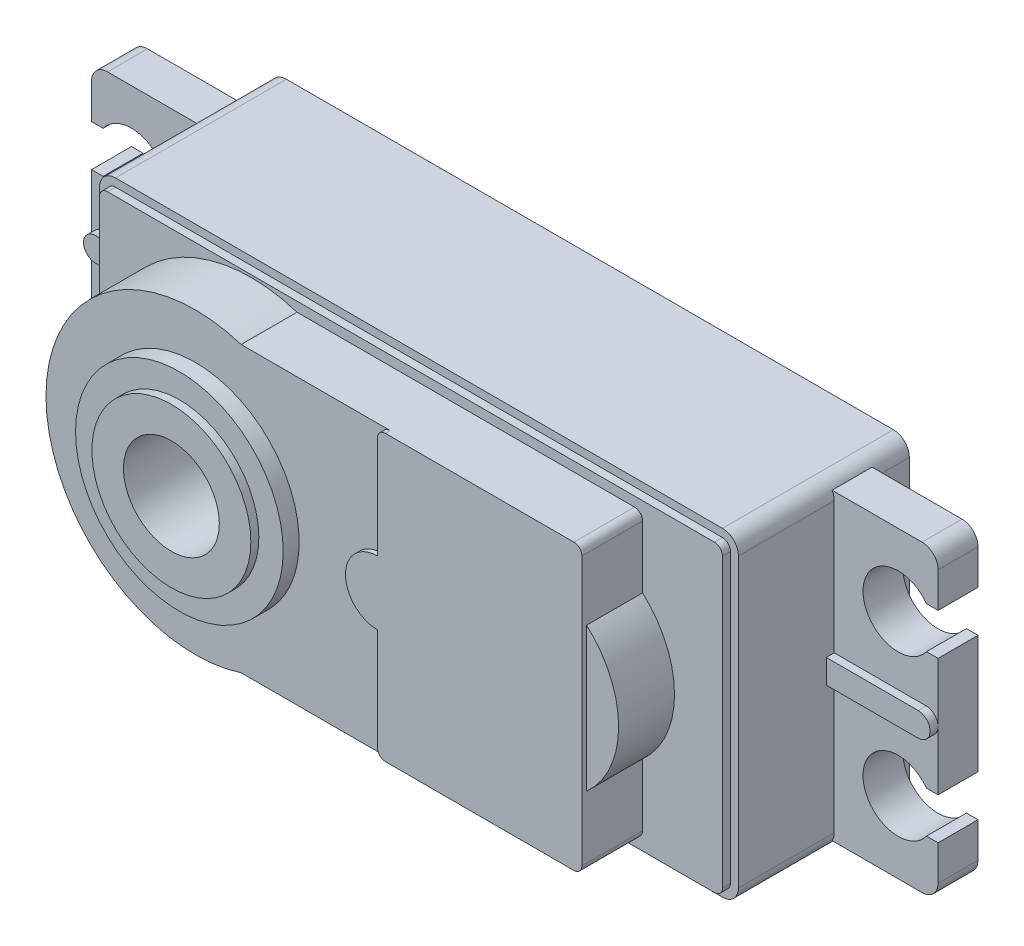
ISO-10303-21;
HEADER;
FILE_DESCRIPTION(('STEP AP214'),'2;1');
FILE_NAME('part.step','',(''),(''),'','','');
FILE_SCHEMA(('AUTOMOTIVE_DESIGN { 1 0 10303 214 1 1 1 1 }'));
ENDSEC;
DATA;
#1=APPLICATION_CONTEXT('core data for automotive mechanical design processes');
#2=APPLICATION_PROTOCOL_DEFINITION('international standard','automotive_design',2000,#1);
#3=PRODUCT_CONTEXT('',#1,'mechanical');
#4=PRODUCT('Part','Part','',(#3));
#5=PRODUCT_RELATED_PRODUCT_CATEGORY('part','',(#4));
#6=PRODUCT_DEFINITION_FORMATION('','',#4);
#7=PRODUCT_DEFINITION_CONTEXT('part definition',#1,'design');
#8=PRODUCT_DEFINITION('design','',#6,#7);
#9=PRODUCT_DEFINITION_SHAPE('','',#8);
#10=(LENGTH_UNIT() NAMED_UNIT(*) SI_UNIT(.MILLI.,.METRE.));
#11=(NAMED_UNIT(*) PLANE_ANGLE_UNIT() SI_UNIT($,.RADIAN.));
#12=(NAMED_UNIT(*) SI_UNIT($,.STERADIAN.) SOLID_ANGLE_UNIT());
#13=UNCERTAINTY_MEASURE_WITH_UNIT(LENGTH_MEASURE(1.E-05),#10,'distance_accuracy_value','');
#14=(GEOMETRIC_REPRESENTATION_CONTEXT(3) GLOBAL_UNCERTAINTY_ASSIGNED_CONTEXT((#13)) GLOBAL_UNIT_ASSIGNED_CONTEXT((#10,
#11,#12)) REPRESENTATION_CONTEXT('',''));
#15=CARTESIAN_POINT('',(0.,0.,0.));
#16=DIRECTION('',(0.,0.,1.));
#17=DIRECTION('',(1.,0.,0.));
#18=AXIS2_PLACEMENT_3D('',#15,#16,#17);
#19=CARTESIAN_POINT('',(25.5,-8.5,4.7));
#20=DIRECTION('',(0.,0.,-1.));
#21=DIRECTION('',(1.,0.,0.));
#22=AXIS2_PLACEMENT_3D('',#19,#20,#21);
#23=PLANE('',#22);
#24=DIRECTION('',(0.,-1.,0.));
#25=VECTOR('',#24,1.);
#26=CARTESIAN_POINT('',(20.,-9.00000000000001,4.7));
#27=LINE('',#26,#25);
#28=CARTESIAN_POINT('',(20.,9.00000000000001,4.7));
#29=VERTEX_POINT('',#28);
#30=CARTESIAN_POINT('',(20.,0.75,4.7));
#31=VERTEX_POINT('',#30);
#32=EDGE_CURVE('E616',#29,#31,#27,.T.);
#33=ORIENTED_EDGE('',*,*,#32,.T.);
#34=DIRECTION('',(1.,0.,0.));
#35=VECTOR('',#34,1.);
#36=CARTESIAN_POINT('',(20.,0.75,4.7));
#37=LINE('',#36,#35);
#38=CARTESIAN_POINT('',(25.75,0.749999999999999,4.7));
#39=VERTEX_POINT('',#38);
#40=EDGE_CURVE('E1179',#31,#39,#37,.T.);
#41=ORIENTED_EDGE('',*,*,#40,.T.);
#42=CARTESIAN_POINT('',(25.75,0.,4.7));
#43=DIRECTION('',(0.,0.,-1.));
#44=DIRECTION('',(-1.,0.,0.));
#45=AXIS2_PLACEMENT_3D('',#42,#43,#44);
#46=CIRCLE('',#45,0.75);
#47=CARTESIAN_POINT('',(26.5,0.,4.7));
#48=VERTEX_POINT('',#47);
#49=EDGE_CURVE('E495',#39,#48,#46,.T.);
#50=ORIENTED_EDGE('',*,*,#49,.T.);
#51=DIRECTION('',(0.,1.,0.));
#52=VECTOR('',#51,1.);
#53=CARTESIAN_POINT('',(26.5,3.7,4.7));
#54=LINE('',#53,#52);
#55=CARTESIAN_POINT('',(26.5,3.7,4.7));
#56=VERTEX_POINT('',#55);
#57=EDGE_CURVE('E528',#48,#56,#54,.T.);
#58=ORIENTED_EDGE('',*,*,#57,.T.);
#59=DIRECTION('',(-1.,0.,0.));
#60=VECTOR('',#59,1.);
#61=CARTESIAN_POINT('',(25.7748239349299,3.7,4.7));
#62=LINE('',#61,#60);
#63=CARTESIAN_POINT('',(25.7748239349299,3.7,4.7));
#64=VERTEX_POINT('',#63);
#65=EDGE_CURVE('E526',#56,#64,#62,.T.);
#66=ORIENTED_EDGE('',*,*,#65,.T.);
#67=CARTESIAN_POINT('',(24.,5.,4.7));
#68=DIRECTION('',(0.,0.,-1.));
#69=DIRECTION('',(1.,0.,0.));
#70=AXIS2_PLACEMENT_3D('',#67,#68,#69);
#71=CIRCLE('',#70,2.2);
#72=CARTESIAN_POINT('',(25.7748239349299,6.3,4.7));
#73=VERTEX_POINT('',#72);
#74=EDGE_CURVE('E524',#64,#73,#71,.T.);
#75=ORIENTED_EDGE('',*,*,#74,.T.);
#76=DIRECTION('',(1.,0.,0.));
#77=VECTOR('',#76,1.);
#78=CARTESIAN_POINT('',(25.7748239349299,6.3,4.7));
#79=LINE('',#78,#77);
#80=CARTESIAN_POINT('',(26.5,6.3,4.7));
#81=VERTEX_POINT('',#80);
#82=EDGE_CURVE('E522',#73,#81,#79,.T.);
#83=ORIENTED_EDGE('',*,*,#82,.T.);
#84=DIRECTION('',(0.,1.,0.));
#85=VECTOR('',#84,1.);
#86=CARTESIAN_POINT('',(26.5,8.5,4.7));
#87=LINE('',#86,#85);
#88=CARTESIAN_POINT('',(26.5,8.5,4.7));
#89=VERTEX_POINT('',#88);
#90=EDGE_CURVE('E520',#81,#89,#87,.T.);
#91=ORIENTED_EDGE('',*,*,#90,.T.);
#92=CARTESIAN_POINT('',(25.5,8.5,4.7));
#93=DIRECTION('',(0.,0.,1.));
#94=DIRECTION('',(1.,0.,0.));
#95=AXIS2_PLACEMENT_3D('',#92,#93,#94);
#96=CIRCLE('',#95,1.);
#97=CARTESIAN_POINT('',(25.5,9.5,4.7));
#98=VERTEX_POINT('',#97);
#99=EDGE_CURVE('E517',#89,#98,#96,.T.);
#100=ORIENTED_EDGE('',*,*,#99,.T.);
#101=DIRECTION('',(-1.,0.,0.));
#102=VECTOR('',#101,1.);
#103=CARTESIAN_POINT('',(19.8660254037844,9.5,4.7));
#104=LINE('',#103,#102);
#105=CARTESIAN_POINT('',(19.8660254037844,9.5,4.7));
#106=VERTEX_POINT('',#105);
#107=EDGE_CURVE('E515',#98,#106,#104,.T.);
#108=ORIENTED_EDGE('',*,*,#107,.T.);
#109=CARTESIAN_POINT('',(19.,9.,4.7));
#110=DIRECTION('',(0.,0.,-1.));
#111=DIRECTION('',(-1.,0.,0.));
#112=AXIS2_PLACEMENT_3D('',#109,#110,#111);
#113=CIRCLE('',#112,0.999999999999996);
#114=EDGE_CURVE('E12',#106,#29,#113,.T.);
#115=ORIENTED_EDGE('',*,*,#114,.T.);
#116=EDGE_LOOP('',(#33,#41,#50,#58,#66,#75,#83,#91,#100,#108,#115));
#117=FACE_BOUND('',#116,.T.);
#118=ADVANCED_FACE('F37',(#117),#23,.F.);
#119=CARTESIAN_POINT('',(19.,-9.,10.7));
#120=DIRECTION('',(0.,0.,-1.));
#121=DIRECTION('',(-1.,0.,0.));
#122=AXIS2_PLACEMENT_3D('',#119,#120,#121);
#123=CYLINDRICAL_SURFACE('',#122,0.999999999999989);
#124=CARTESIAN_POINT('',(19.,-9.,4.7));
#125=DIRECTION('',(0.,0.,-1.));
#126=DIRECTION('',(-1.,0.,0.));
#127=AXIS2_PLACEMENT_3D('',#124,#125,#126);
#128=CIRCLE('',#127,0.999999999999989);
#129=CARTESIAN_POINT('',(20.,-9.00000000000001,4.7));
#130=VERTEX_POINT('',#129);
#131=CARTESIAN_POINT('',(19.8660254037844,-9.5,4.7));
#132=VERTEX_POINT('',#131);
#133=EDGE_CURVE('E619',#130,#132,#128,.T.);
#134=ORIENTED_EDGE('',*,*,#133,.F.);
#135=DIRECTION('',(0.,0.,-1.));
#136=VECTOR('',#135,1.);
#137=CARTESIAN_POINT('',(20.,-9.00000000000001,10.7));
#138=LINE('',#137,#136);
#139=CARTESIAN_POINT('',(20.,-9.00000000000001,10.7));
#140=VERTEX_POINT('',#139);
#141=EDGE_CURVE('E871',#140,#130,#138,.T.);
#142=ORIENTED_EDGE('',*,*,#141,.F.);
#143=CARTESIAN_POINT('',(19.,-9.,10.7));
#144=DIRECTION('',(0.,0.,1.));
#145=DIRECTION('',(1.,0.,0.));
#146=AXIS2_PLACEMENT_3D('',#143,#144,#145);
#147=CIRCLE('',#146,0.999999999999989);
#148=CARTESIAN_POINT('',(19.,-9.99999999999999,10.7));
#149=VERTEX_POINT('',#148);
#150=EDGE_CURVE('E997',#149,#140,#147,.T.);
#151=ORIENTED_EDGE('',*,*,#150,.F.);
#152=DIRECTION('',(0.,0.,-1.));
#153=VECTOR('',#152,1.);
#154=CARTESIAN_POINT('',(19.,-9.99999999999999,10.7));
#155=LINE('',#154,#153);
#156=CARTESIAN_POINT('',(19.,-9.99999999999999,0.));
#157=VERTEX_POINT('',#156);
#158=EDGE_CURVE('E874',#149,#157,#155,.T.);
#159=ORIENTED_EDGE('',*,*,#158,.T.);
#160=CARTESIAN_POINT('',(19.,-9.,0.));
#161=DIRECTION('',(0.,0.,1.));
#162=DIRECTION('',(1.,0.,0.));
#163=AXIS2_PLACEMENT_3D('',#160,#161,#162);
#164=CIRCLE('',#163,0.999999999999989);
#165=CARTESIAN_POINT('',(20.,-9.00000000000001,0.));
#166=VERTEX_POINT('',#165);
#167=EDGE_CURVE('E1014',#157,#166,#164,.T.);
#168=ORIENTED_EDGE('',*,*,#167,.T.);
#169=CARTESIAN_POINT('',(20.,-9.00000000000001,2.2));
#170=VERTEX_POINT('',#169);
#171=EDGE_CURVE('E865',#170,#166,#138,.T.);
#172=ORIENTED_EDGE('',*,*,#171,.F.);
#173=CARTESIAN_POINT('',(19.,-9.,2.2));
#174=DIRECTION('',(0.,0.,-1.));
#175=DIRECTION('',(-1.,0.,0.));
#176=AXIS2_PLACEMENT_3D('',#173,#174,#175);
#177=CIRCLE('',#176,0.999999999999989);
#178=CARTESIAN_POINT('',(19.8660254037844,-9.5,2.2));
#179=VERTEX_POINT('',#178);
#180=EDGE_CURVE('E612',#170,#179,#177,.T.);
#181=ORIENTED_EDGE('',*,*,#180,.T.);
#182=DIRECTION('',(0.,0.,-1.));
#183=VECTOR('',#182,1.);
#184=CARTESIAN_POINT('',(19.8660254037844,-9.5,4.7));
#185=LINE('',#184,#183);
#186=EDGE_CURVE('E570',#132,#179,#185,.T.);
#187=ORIENTED_EDGE('',*,*,#186,.F.);
#188=EDGE_LOOP('',(#134,#142,#151,#159,#168,#172,#181,#187));
#189=FACE_BOUND('',#188,.T.);
#190=ADVANCED_FACE('F1081',(#189),#123,.T.);
#191=CARTESIAN_POINT('',(20.,-9.00000000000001,10.7));
#192=DIRECTION('',(-1.,0.,0.));
#193=DIRECTION('',(0.,-1.,0.));
#194=AXIS2_PLACEMENT_3D('',#191,#192,#193);
#195=PLANE('',#194);
#196=DIRECTION('',(0.,1.,0.));
#197=VECTOR('',#196,1.);
#198=CARTESIAN_POINT('',(20.,0.75,5.2));
#199=LINE('',#198,#197);
#200=CARTESIAN_POINT('',(20.,-0.75,5.2));
#201=VERTEX_POINT('',#200);
#202=CARTESIAN_POINT('',(20.,0.75,5.2));
#203=VERTEX_POINT('',#202);
#204=EDGE_CURVE('E508',#201,#203,#199,.T.);
#205=ORIENTED_EDGE('',*,*,#204,.T.);
#206=DIRECTION('',(0.,0.,-1.));
#207=VECTOR('',#206,1.);
#208=CARTESIAN_POINT('',(20.,0.75,17.8708320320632));
#209=LINE('',#208,#207);
#210=EDGE_CURVE('E501',#203,#31,#209,.T.);
#211=ORIENTED_EDGE('',*,*,#210,.T.);
#212=ORIENTED_EDGE('',*,*,#32,.F.);
#213=DIRECTION('',(0.,0.,-1.));
#214=VECTOR('',#213,1.);
#215=CARTESIAN_POINT('',(20.,9.00000000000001,10.7));
#216=LINE('',#215,#214);
#217=CARTESIAN_POINT('',(20.,9.00000000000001,10.7));
#218=VERTEX_POINT('',#217);
#219=EDGE_CURVE('E861',#218,#29,#216,.T.);
#220=ORIENTED_EDGE('',*,*,#219,.F.);
#221=DIRECTION('',(0.,1.,0.));
#222=VECTOR('',#221,1.);
#223=CARTESIAN_POINT('',(20.,-9.00000000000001,10.7));
#224=LINE('',#223,#222);
#225=EDGE_CURVE('E999',#140,#218,#224,.T.);
#226=ORIENTED_EDGE('',*,*,#225,.F.);
#227=ORIENTED_EDGE('',*,*,#141,.T.);
#228=CARTESIAN_POINT('',(20.,-0.750000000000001,4.7));
#229=VERTEX_POINT('',#228);
#230=EDGE_CURVE('E615',#229,#130,#27,.T.);
#231=ORIENTED_EDGE('',*,*,#230,.F.);
#232=DIRECTION('',(0.,0.,-1.));
#233=VECTOR('',#232,1.);
#234=CARTESIAN_POINT('',(20.,-0.75,17.8708320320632));
#235=LINE('',#234,#233);
#236=EDGE_CURVE('E52',#201,#229,#235,.T.);
#237=ORIENTED_EDGE('',*,*,#236,.F.);
#238=EDGE_LOOP('',(#205,#211,#212,#220,#226,#227,#231,#237));
#239=FACE_BOUND('',#238,.T.);
#240=ADVANCED_FACE('F1151',(#239),#195,.F.);
#241=CARTESIAN_POINT('',(19.,9.,10.7));
#242=DIRECTION('',(0.,0.,-1.));
#243=DIRECTION('',(-1.,0.,0.));
#244=AXIS2_PLACEMENT_3D('',#241,#242,#243);
#245=CYLINDRICAL_SURFACE('',#244,0.999999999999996);
#246=ORIENTED_EDGE('',*,*,#114,.F.);
#247=DIRECTION('',(0.,0.,-1.));
#248=VECTOR('',#247,1.);
#249=CARTESIAN_POINT('',(19.8660254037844,9.5,4.7));
#250=LINE('',#249,#248);
#251=CARTESIAN_POINT('',(19.8660254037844,9.5,2.2));
#252=VERTEX_POINT('',#251);
#253=EDGE_CURVE('E544',#106,#252,#250,.T.);
#254=ORIENTED_EDGE('',*,*,#253,.T.);
#255=CARTESIAN_POINT('',(19.,9.,2.2));
#256=DIRECTION('',(0.,0.,-1.));
#257=DIRECTION('',(-1.,0.,0.));
#258=AXIS2_PLACEMENT_3D('',#255,#256,#257);
#259=CIRCLE('',#258,0.999999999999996);
#260=CARTESIAN_POINT('',(20.,9.00000000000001,2.2));
#261=VERTEX_POINT('',#260);
#262=EDGE_CURVE('E45',#252,#261,#259,.T.);
#263=ORIENTED_EDGE('',*,*,#262,.T.);
#264=CARTESIAN_POINT('',(20.,9.00000000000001,0.));
#265=VERTEX_POINT('',#264);
#266=EDGE_CURVE('E851',#261,#265,#216,.T.);
#267=ORIENTED_EDGE('',*,*,#266,.T.);
#268=CARTESIAN_POINT('',(19.,9.,0.));
#269=DIRECTION('',(0.,0.,1.));
#270=DIRECTION('',(1.,0.,0.));
#271=AXIS2_PLACEMENT_3D('',#268,#269,#270);
#272=CIRCLE('',#271,0.999999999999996);
#273=CARTESIAN_POINT('',(19.,9.99999999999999,0.));
#274=VERTEX_POINT('',#273);
#275=EDGE_CURVE('E1018',#265,#274,#272,.T.);
#276=ORIENTED_EDGE('',*,*,#275,.T.);
#277=DIRECTION('',(0.,0.,-1.));
#278=VECTOR('',#277,1.);
#279=CARTESIAN_POINT('',(19.,9.99999999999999,10.7));
#280=LINE('',#279,#278);
#281=CARTESIAN_POINT('',(19.,9.99999999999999,10.7));
#282=VERTEX_POINT('',#281);
#283=EDGE_CURVE('E862',#282,#274,#280,.T.);
#284=ORIENTED_EDGE('',*,*,#283,.F.);
#285=CARTESIAN_POINT('',(19.,9.,10.7));
#286=DIRECTION('',(0.,0.,1.));
#287=DIRECTION('',(1.,0.,0.));
#288=AXIS2_PLACEMENT_3D('',#285,#286,#287);
#289=CIRCLE('',#288,0.999999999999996);
#290=EDGE_CURVE('E1001',#218,#282,#289,.T.);
#291=ORIENTED_EDGE('',*,*,#290,.F.);
#292=ORIENTED_EDGE('',*,*,#219,.T.);
#293=EDGE_LOOP('',(#246,#254,#263,#267,#276,#284,#291,#292));
#294=FACE_BOUND('',#293,.T.);
#295=ADVANCED_FACE('F850',(#294),#245,.T.);
#296=CARTESIAN_POINT('',(-20.,9.,10.7));
#297=DIRECTION('',(1.,0.,0.));
#298=DIRECTION('',(0.,0.,-1.));
#299=AXIS2_PLACEMENT_3D('',#296,#297,#298);
#300=PLANE('',#299);
#301=DIRECTION('',(0.,0.,-1.));
#302=VECTOR('',#301,1.);
#303=CARTESIAN_POINT('',(-20.,0.75,17.8708320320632));
#304=LINE('',#303,#302);
#305=CARTESIAN_POINT('',(-20.,0.750000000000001,5.2));
#306=VERTEX_POINT('',#305);
#307=CARTESIAN_POINT('',(-20.,0.750000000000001,4.7));
#308=VERTEX_POINT('',#307);
#309=EDGE_CURVE('E635',#306,#308,#304,.T.);
#310=ORIENTED_EDGE('',*,*,#309,.F.);
#311=DIRECTION('',(0.,1.,0.));
#312=VECTOR('',#311,1.);
#313=CARTESIAN_POINT('',(-20.,0.75,5.2));
#314=LINE('',#313,#312);
#315=CARTESIAN_POINT('',(-20.,-0.750000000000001,5.2));
#316=VERTEX_POINT('',#315);
#317=EDGE_CURVE('E643',#316,#306,#314,.T.);
#318=ORIENTED_EDGE('',*,*,#317,.F.);
#319=DIRECTION('',(0.,0.,-1.));
#320=VECTOR('',#319,1.);
#321=CARTESIAN_POINT('',(-20.,-0.75,17.8708320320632));
#322=LINE('',#321,#320);
#323=CARTESIAN_POINT('',(-20.,-0.75,4.7));
#324=VERTEX_POINT('',#323);
#325=EDGE_CURVE('E621',#316,#324,#322,.T.);
#326=ORIENTED_EDGE('',*,*,#325,.T.);
#327=DIRECTION('',(0.,1.,0.));
#328=VECTOR('',#327,1.);
#329=CARTESIAN_POINT('',(-20.,9.,4.7));
#330=LINE('',#329,#328);
#331=CARTESIAN_POINT('',(-20.,-9.,4.7));
#332=VERTEX_POINT('',#331);
#333=EDGE_CURVE('E846',#332,#324,#330,.T.);
#334=ORIENTED_EDGE('',*,*,#333,.F.);
#335=DIRECTION('',(0.,0.,-1.));
#336=VECTOR('',#335,1.);
#337=CARTESIAN_POINT('',(-20.,-9.,10.7));
#338=LINE('',#337,#336);
#339=CARTESIAN_POINT('',(-20.,-9.,10.7));
#340=VERTEX_POINT('',#339);
#341=EDGE_CURVE('E1027',#340,#332,#338,.T.);
#342=ORIENTED_EDGE('',*,*,#341,.F.);
#343=DIRECTION('',(0.,-1.,0.));
#344=VECTOR('',#343,1.);
#345=CARTESIAN_POINT('',(-20.,9.,10.7));
#346=LINE('',#345,#344);
#347=CARTESIAN_POINT('',(-20.,9.,10.7));
#348=VERTEX_POINT('',#347);
#349=EDGE_CURVE('E1007',#348,#340,#346,.T.);
#350=ORIENTED_EDGE('',*,*,#349,.F.);
#351=DIRECTION('',(0.,0.,-1.));
#352=VECTOR('',#351,1.);
#353=CARTESIAN_POINT('',(-20.,9.,10.7));
#354=LINE('',#353,#352);
#355=CARTESIAN_POINT('',(-20.,9.,4.7));
#356=VERTEX_POINT('',#355);
#357=EDGE_CURVE('E1031',#348,#356,#354,.T.);
#358=ORIENTED_EDGE('',*,*,#357,.T.);
#359=EDGE_CURVE('E845',#308,#356,#330,.T.);
#360=ORIENTED_EDGE('',*,*,#359,.F.);
#361=EDGE_LOOP('',(#310,#318,#326,#334,#342,#350,#358,#360));
#362=FACE_BOUND('',#361,.T.);
#363=ADVANCED_FACE('F1067',(#362),#300,.F.);
#364=CARTESIAN_POINT('',(-25.5,-8.5,4.7));
#365=DIRECTION('',(0.,0.,-1.));
#366=DIRECTION('',(-1.,0.,0.));
#367=AXIS2_PLACEMENT_3D('',#364,#365,#366);
#368=PLANE('',#367);
#369=DIRECTION('',(-1.,0.,0.));
#370=VECTOR('',#369,1.);
#371=CARTESIAN_POINT('',(-20.,0.75,4.7));
#372=LINE('',#371,#370);
#373=CARTESIAN_POINT('',(-25.75,0.749999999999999,4.7));
#374=VERTEX_POINT('',#373);
#375=EDGE_CURVE('E631',#308,#374,#372,.T.);
#376=ORIENTED_EDGE('',*,*,#375,.F.);
#377=ORIENTED_EDGE('',*,*,#359,.T.);
#378=CARTESIAN_POINT('',(-19.,8.99999999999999,4.7));
#379=DIRECTION('',(0.,0.,-1.));
#380=DIRECTION('',(-1.,0.,0.));
#381=AXIS2_PLACEMENT_3D('',#378,#379,#380);
#382=CIRCLE('',#381,0.999999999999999);
#383=CARTESIAN_POINT('',(-19.8660254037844,9.5,4.7));
#384=VERTEX_POINT('',#383);
#385=EDGE_CURVE('E769',#356,#384,#382,.T.);
#386=ORIENTED_EDGE('',*,*,#385,.T.);
#387=DIRECTION('',(1.,0.,0.));
#388=VECTOR('',#387,1.);
#389=CARTESIAN_POINT('',(-19.8660254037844,9.5,4.7));
#390=LINE('',#389,#388);
#391=CARTESIAN_POINT('',(-25.5,9.5,4.7));
#392=VERTEX_POINT('',#391);
#393=EDGE_CURVE('E694',#392,#384,#390,.T.);
#394=ORIENTED_EDGE('',*,*,#393,.F.);
#395=CARTESIAN_POINT('',(-25.5,8.5,4.7));
#396=DIRECTION('',(0.,0.,-1.));
#397=DIRECTION('',(-1.,0.,0.));
#398=AXIS2_PLACEMENT_3D('',#395,#396,#397);
#399=CIRCLE('',#398,1.);
#400=CARTESIAN_POINT('',(-26.5,8.5,4.7));
#401=VERTEX_POINT('',#400);
#402=EDGE_CURVE('E691',#401,#392,#399,.T.);
#403=ORIENTED_EDGE('',*,*,#402,.F.);
#404=DIRECTION('',(0.,1.,0.));
#405=VECTOR('',#404,1.);
#406=CARTESIAN_POINT('',(-26.5,8.5,4.7));
#407=LINE('',#406,#405);
#408=CARTESIAN_POINT('',(-26.5,6.3,4.7));
#409=VERTEX_POINT('',#408);
#410=EDGE_CURVE('E688',#409,#401,#407,.T.);
#411=ORIENTED_EDGE('',*,*,#410,.F.);
#412=DIRECTION('',(-1.,0.,0.));
#413=VECTOR('',#412,1.);
#414=CARTESIAN_POINT('',(-25.7748239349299,6.3,4.7));
#415=LINE('',#414,#413);
#416=CARTESIAN_POINT('',(-25.7748239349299,6.3,4.7));
#417=VERTEX_POINT('',#416);
#418=EDGE_CURVE('E685',#417,#409,#415,.T.);
#419=ORIENTED_EDGE('',*,*,#418,.F.);
#420=CARTESIAN_POINT('',(-24.,5.,4.7));
#421=DIRECTION('',(0.,0.,1.));
#422=DIRECTION('',(-1.,0.,0.));
#423=AXIS2_PLACEMENT_3D('',#420,#421,#422);
#424=CIRCLE('',#423,2.2);
#425=CARTESIAN_POINT('',(-25.7748239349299,3.7,4.7));
#426=VERTEX_POINT('',#425);
#427=EDGE_CURVE('E682',#426,#417,#424,.T.);
#428=ORIENTED_EDGE('',*,*,#427,.F.);
#429=DIRECTION('',(1.,0.,0.));
#430=VECTOR('',#429,1.);
#431=CARTESIAN_POINT('',(-25.7748239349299,3.7,4.7));
#432=LINE('',#431,#430);
#433=CARTESIAN_POINT('',(-26.5,3.7,4.7));
#434=VERTEX_POINT('',#433);
#435=EDGE_CURVE('E679',#434,#426,#432,.T.);
#436=ORIENTED_EDGE('',*,*,#435,.F.);
#437=DIRECTION('',(0.,1.,0.));
#438=VECTOR('',#437,1.);
#439=CARTESIAN_POINT('',(-26.5,3.7,4.7));
#440=LINE('',#439,#438);
#441=CARTESIAN_POINT('',(-26.5,0.,4.7));
#442=VERTEX_POINT('',#441);
#443=EDGE_CURVE('E675',#442,#434,#440,.T.);
#444=ORIENTED_EDGE('',*,*,#443,.F.);
#445=CARTESIAN_POINT('',(-25.75,0.,4.7));
#446=DIRECTION('',(0.,0.,1.));
#447=DIRECTION('',(1.,0.,0.));
#448=AXIS2_PLACEMENT_3D('',#445,#446,#447);
#449=CIRCLE('',#448,0.75);
#450=EDGE_CURVE('E627',#374,#442,#449,.T.);
#451=ORIENTED_EDGE('',*,*,#450,.F.);
#452=EDGE_LOOP('',(#376,#377,#386,#394,#403,#411,#419,#428,#436,#444,#451));
#453=FACE_BOUND('',#452,.T.);
#454=ADVANCED_FACE('F1062',(#453),#368,.F.);
#455=CARTESIAN_POINT('',(-25.75,-0.750000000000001,4.7));
#456=VERTEX_POINT('',#455);
#457=EDGE_CURVE('E630',#442,#456,#449,.T.);
#458=ORIENTED_EDGE('',*,*,#457,.F.);
#459=CARTESIAN_POINT('',(-26.5,-3.7,4.7));
#460=VERTEX_POINT('',#459);
#461=EDGE_CURVE('E676',#460,#442,#440,.T.);
#462=ORIENTED_EDGE('',*,*,#461,.F.);
#463=DIRECTION('',(-1.,0.,0.));
#464=VECTOR('',#463,1.);
#465=CARTESIAN_POINT('',(-25.7748239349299,-3.7,4.7));
#466=LINE('',#465,#464);
#467=CARTESIAN_POINT('',(-25.7748239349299,-3.7,4.7));
#468=VERTEX_POINT('',#467);
#469=EDGE_CURVE('E672',#468,#460,#466,.T.);
#470=ORIENTED_EDGE('',*,*,#469,.F.);
#471=CARTESIAN_POINT('',(-24.,-5.,4.7));
#472=DIRECTION('',(0.,0.,1.));
#473=DIRECTION('',(1.,0.,0.));
#474=AXIS2_PLACEMENT_3D('',#471,#472,#473);
#475=CIRCLE('',#474,2.2);
#476=CARTESIAN_POINT('',(-25.7748239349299,-6.3,4.7));
#477=VERTEX_POINT('',#476);
#478=EDGE_CURVE('E669',#477,#468,#475,.T.);
#479=ORIENTED_EDGE('',*,*,#478,.F.);
#480=DIRECTION('',(1.,0.,0.));
#481=VECTOR('',#480,1.);
#482=CARTESIAN_POINT('',(-25.7748239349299,-6.3,4.7));
#483=LINE('',#482,#481);
#484=CARTESIAN_POINT('',(-26.5,-6.3,4.7));
#485=VERTEX_POINT('',#484);
#486=EDGE_CURVE('E666',#485,#477,#483,.T.);
#487=ORIENTED_EDGE('',*,*,#486,.F.);
#488=DIRECTION('',(0.,1.,0.));
#489=VECTOR('',#488,1.);
#490=CARTESIAN_POINT('',(-26.5,-6.3,4.7));
#491=LINE('',#490,#489);
#492=CARTESIAN_POINT('',(-26.5,-8.5,4.7));
#493=VERTEX_POINT('',#492);
#494=EDGE_CURVE('E663',#493,#485,#491,.T.);
#495=ORIENTED_EDGE('',*,*,#494,.F.);
#496=CARTESIAN_POINT('',(-25.5,-8.5,4.7));
#497=DIRECTION('',(0.,0.,-1.));
#498=DIRECTION('',(-1.,0.,0.));
#499=AXIS2_PLACEMENT_3D('',#496,#497,#498);
#500=CIRCLE('',#499,1.);
#501=CARTESIAN_POINT('',(-25.5,-9.5,4.7));
#502=VERTEX_POINT('',#501);
#503=EDGE_CURVE('E659',#502,#493,#500,.T.);
#504=ORIENTED_EDGE('',*,*,#503,.F.);
#505=DIRECTION('',(-1.,0.,0.));
#506=VECTOR('',#505,1.);
#507=CARTESIAN_POINT('',(-19.8660254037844,-9.5,4.7));
#508=LINE('',#507,#506);
#509=CARTESIAN_POINT('',(-19.8660254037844,-9.5,4.7));
#510=VERTEX_POINT('',#509);
#511=EDGE_CURVE('E656',#510,#502,#508,.T.);
#512=ORIENTED_EDGE('',*,*,#511,.F.);
#513=CARTESIAN_POINT('',(-19.,-8.99999999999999,4.7));
#514=DIRECTION('',(0.,0.,-1.));
#515=DIRECTION('',(-1.,0.,0.));
#516=AXIS2_PLACEMENT_3D('',#513,#514,#515);
#517=CIRCLE('',#516,0.999999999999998);
#518=EDGE_CURVE('E771',#510,#332,#517,.T.);
#519=ORIENTED_EDGE('',*,*,#518,.T.);
#520=ORIENTED_EDGE('',*,*,#333,.T.);
#521=DIRECTION('',(1.,0.,0.));
#522=VECTOR('',#521,1.);
#523=CARTESIAN_POINT('',(-20.,-0.75,4.7));
#524=LINE('',#523,#522);
#525=EDGE_CURVE('E622',#456,#324,#524,.T.);
#526=ORIENTED_EDGE('',*,*,#525,.F.);
#527=EDGE_LOOP('',(#458,#462,#470,#479,#487,#495,#504,#512,#519,#520,#526));
#528=FACE_BOUND('',#527,.T.);
#529=ADVANCED_FACE('F1262',(#528),#368,.F.);
#530=CARTESIAN_POINT('',(-19.,-8.99999999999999,10.7));
#531=DIRECTION('',(0.,0.,-1.));
#532=DIRECTION('',(-1.,0.,0.));
#533=AXIS2_PLACEMENT_3D('',#530,#531,#532);
#534=CYLINDRICAL_SURFACE('',#533,0.999999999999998);
#535=ORIENTED_EDGE('',*,*,#518,.F.);
#536=DIRECTION('',(0.,0.,-1.));
#537=VECTOR('',#536,1.);
#538=CARTESIAN_POINT('',(-19.8660254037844,-9.5,4.7));
#539=LINE('',#538,#537);
#540=CARTESIAN_POINT('',(-19.8660254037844,-9.5,2.2));
#541=VERTEX_POINT('',#540);
#542=EDGE_CURVE('E697',#510,#541,#539,.T.);
#543=ORIENTED_EDGE('',*,*,#542,.T.);
#544=CARTESIAN_POINT('',(-19.,-8.99999999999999,2.2));
#545=DIRECTION('',(0.,0.,-1.));
#546=DIRECTION('',(-1.,0.,0.));
#547=AXIS2_PLACEMENT_3D('',#544,#545,#546);
#548=CIRCLE('',#547,0.999999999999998);
#549=CARTESIAN_POINT('',(-20.,-9.,2.2));
#550=VERTEX_POINT('',#549);
#551=EDGE_CURVE('E766',#541,#550,#548,.T.);
#552=ORIENTED_EDGE('',*,*,#551,.T.);
#553=CARTESIAN_POINT('',(-20.,-9.,0.));
#554=VERTEX_POINT('',#553);
#555=EDGE_CURVE('E1009',#550,#554,#338,.T.);
#556=ORIENTED_EDGE('',*,*,#555,.T.);
#557=CARTESIAN_POINT('',(-19.,-8.99999999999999,0.));
#558=DIRECTION('',(0.,0.,1.));
#559=DIRECTION('',(1.,0.,0.));
#560=AXIS2_PLACEMENT_3D('',#557,#558,#559);
#561=CIRCLE('',#560,0.999999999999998);
#562=CARTESIAN_POINT('',(-19.,-9.99999999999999,0.));
#563=VERTEX_POINT('',#562);
#564=EDGE_CURVE('E990',#554,#563,#561,.T.);
#565=ORIENTED_EDGE('',*,*,#564,.T.);
#566=DIRECTION('',(0.,0.,-1.));
#567=VECTOR('',#566,1.);
#568=CARTESIAN_POINT('',(-19.,-9.99999999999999,10.7));
#569=LINE('',#568,#567);
#570=CARTESIAN_POINT('',(-19.,-9.99999999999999,10.7));
#571=VERTEX_POINT('',#570);
#572=EDGE_CURVE('E877',#571,#563,#569,.T.);
#573=ORIENTED_EDGE('',*,*,#572,.F.);
#574=CARTESIAN_POINT('',(-19.,-8.99999999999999,10.7));
#575=DIRECTION('',(0.,0.,1.));
#576=DIRECTION('',(1.,0.,0.));
#577=AXIS2_PLACEMENT_3D('',#574,#575,#576);
#578=CIRCLE('',#577,0.999999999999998);
#579=EDGE_CURVE('E991',#340,#571,#578,.T.);
#580=ORIENTED_EDGE('',*,*,#579,.F.);
#581=ORIENTED_EDGE('',*,*,#341,.T.);
#582=EDGE_LOOP('',(#535,#543,#552,#556,#565,#573,#580,#581));
#583=FACE_BOUND('',#582,.T.);
#584=ADVANCED_FACE('F39',(#583),#534,.T.);
#585=CARTESIAN_POINT('',(-19.,8.99999999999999,10.7));
#586=DIRECTION('',(0.,0.,-1.));
#587=DIRECTION('',(-1.,0.,0.));
#588=AXIS2_PLACEMENT_3D('',#585,#586,#587);
#589=CYLINDRICAL_SURFACE('',#588,0.999999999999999);
#590=ORIENTED_EDGE('',*,*,#385,.F.);
#591=ORIENTED_EDGE('',*,*,#357,.F.);
#592=CARTESIAN_POINT('',(-19.,8.99999999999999,10.7));
#593=DIRECTION('',(0.,0.,1.));
#594=DIRECTION('',(1.,0.,0.));
#595=AXIS2_PLACEMENT_3D('',#592,#593,#594);
#596=CIRCLE('',#595,0.999999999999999);
#597=CARTESIAN_POINT('',(-19.,9.99999999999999,10.7));
#598=VERTEX_POINT('',#597);
#599=EDGE_CURVE('E1005',#598,#348,#596,.T.);
#600=ORIENTED_EDGE('',*,*,#599,.F.);
#601=DIRECTION('',(0.,0.,-1.));
#602=VECTOR('',#601,1.);
#603=CARTESIAN_POINT('',(-19.,9.99999999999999,10.7));
#604=LINE('',#603,#602);
#605=CARTESIAN_POINT('',(-19.,9.99999999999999,0.));
#606=VERTEX_POINT('',#605);
#607=EDGE_CURVE('E867',#598,#606,#604,.T.);
#608=ORIENTED_EDGE('',*,*,#607,.T.);
#609=CARTESIAN_POINT('',(-19.,8.99999999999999,0.));
#610=DIRECTION('',(0.,0.,1.));
#611=DIRECTION('',(1.,0.,0.));
#612=AXIS2_PLACEMENT_3D('',#609,#610,#611);
#613=CIRCLE('',#612,0.999999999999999);
#614=CARTESIAN_POINT('',(-20.,9.,0.));
#615=VERTEX_POINT('',#614);
#616=EDGE_CURVE('E1022',#606,#615,#613,.T.);
#617=ORIENTED_EDGE('',*,*,#616,.T.);
#618=CARTESIAN_POINT('',(-20.,9.,2.2));
#619=VERTEX_POINT('',#618);
#620=EDGE_CURVE('E1030',#619,#615,#354,.T.);
#621=ORIENTED_EDGE('',*,*,#620,.F.);
#622=CARTESIAN_POINT('',(-19.,8.99999999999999,2.2));
#623=DIRECTION('',(0.,0.,-1.));
#624=DIRECTION('',(-1.,0.,0.));
#625=AXIS2_PLACEMENT_3D('',#622,#623,#624);
#626=CIRCLE('',#625,0.999999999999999);
#627=CARTESIAN_POINT('',(-19.8660254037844,9.5,2.2));
#628=VERTEX_POINT('',#627);
#629=EDGE_CURVE('E737',#619,#628,#626,.T.);
#630=ORIENTED_EDGE('',*,*,#629,.T.);
#631=DIRECTION('',(0.,0.,-1.));
#632=VECTOR('',#631,1.);
#633=CARTESIAN_POINT('',(-19.8660254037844,9.5,4.7));
#634=LINE('',#633,#632);
#635=EDGE_CURVE('E735',#384,#628,#634,.T.);
#636=ORIENTED_EDGE('',*,*,#635,.F.);
#637=EDGE_LOOP('',(#590,#591,#600,#608,#617,#621,#630,#636));
#638=FACE_BOUND('',#637,.T.);
#639=ADVANCED_FACE('F1039',(#638),#589,.T.);
#640=CARTESIAN_POINT('',(-10.,0.,15.7));
#641=DIRECTION('',(0.,0.,1.));
#642=DIRECTION('',(1.,0.,0.));
#643=AXIS2_PLACEMENT_3D('',#640,#641,#642);
#644=PLANE('',#643);
#645=CARTESIAN_POINT('',(-10.,0.,15.7));
#646=DIRECTION('',(0.,0.,1.));
#647=DIRECTION('',(1.,0.,0.));
#648=AXIS2_PLACEMENT_3D('',#645,#646,#647);
#649=CIRCLE('',#648,6.5);
#650=CARTESIAN_POINT('',(-3.5,0.,15.7));
#651=VERTEX_POINT('',#650);
#652=EDGE_CURVE('E783',#651,#651,#649,.T.);
#653=ORIENTED_EDGE('',*,*,#652,.T.);
#654=EDGE_LOOP('',(#653));
#655=FACE_BOUND('',#654,.T.);
#656=CARTESIAN_POINT('',(-10.,0.,15.7));
#657=DIRECTION('',(0.,0.,1.));
#658=DIRECTION('',(1.,0.,0.));
#659=AXIS2_PLACEMENT_3D('',#656,#657,#658);
#660=CIRCLE('',#659,4.975);
#661=CARTESIAN_POINT('',(-5.025,0.,15.7));
#662=VERTEX_POINT('',#661);
#663=EDGE_CURVE('E777',#662,#662,#660,.T.);
#664=ORIENTED_EDGE('',*,*,#663,.F.);
#665=EDGE_LOOP('',(#664));
#666=FACE_BOUND('',#665,.T.);
#667=ADVANCED_FACE('F1286',(#655,#666),#644,.T.);
#668=CARTESIAN_POINT('',(14.,8.4,14.7));
#669=DIRECTION('',(0.,0.,-1.));
#670=DIRECTION('',(-1.,0.,0.));
#671=AXIS2_PLACEMENT_3D('',#668,#669,#670);
#672=PLANE('',#671);
#673=CARTESIAN_POINT('',(2.2,-8.39999999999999,14.7));
#674=DIRECTION('',(0.,0.,1.));
#675=DIRECTION('',(1.,0.,0.));
#676=AXIS2_PLACEMENT_3D('',#673,#674,#675);
#677=CIRCLE('',#676,0.500000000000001);
#678=CARTESIAN_POINT('',(1.7,-8.39999999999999,14.7));
#679=VERTEX_POINT('',#678);
#680=CARTESIAN_POINT('',(2.2,-8.89999999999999,14.7));
#681=VERTEX_POINT('',#680);
#682=EDGE_CURVE('E793',#679,#681,#677,.T.);
#683=ORIENTED_EDGE('',*,*,#682,.F.);
#684=DIRECTION('',(0.,-1.,0.));
#685=VECTOR('',#684,1.);
#686=CARTESIAN_POINT('',(1.7,-8.39999999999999,14.7));
#687=LINE('',#686,#685);
#688=CARTESIAN_POINT('',(1.7,-2.,14.7));
#689=VERTEX_POINT('',#688);
#690=EDGE_CURVE('E821',#689,#679,#687,.T.);
#691=ORIENTED_EDGE('',*,*,#690,.F.);
#692=CARTESIAN_POINT('',(1.7,0.,14.7));
#693=DIRECTION('',(0.,0.,1.));
#694=DIRECTION('',(1.,0.,0.));
#695=AXIS2_PLACEMENT_3D('',#692,#693,#694);
#696=CIRCLE('',#695,2.);
#697=CARTESIAN_POINT('',(1.7,2.00000000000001,14.7));
#698=VERTEX_POINT('',#697);
#699=EDGE_CURVE('E818',#698,#689,#696,.T.);
#700=ORIENTED_EDGE('',*,*,#699,.F.);
#701=DIRECTION('',(0.,-1.,0.));
#702=VECTOR('',#701,1.);
#703=CARTESIAN_POINT('',(1.7,2.00000000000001,14.7));
#704=LINE('',#703,#702);
#705=CARTESIAN_POINT('',(1.7,8.4,14.7));
#706=VERTEX_POINT('',#705);
#707=EDGE_CURVE('E815',#706,#698,#704,.T.);
#708=ORIENTED_EDGE('',*,*,#707,.F.);
#709=CARTESIAN_POINT('',(2.2,8.4,14.7));
#710=DIRECTION('',(0.,0.,1.));
#711=DIRECTION('',(-1.,0.,0.));
#712=AXIS2_PLACEMENT_3D('',#709,#710,#711);
#713=CIRCLE('',#712,0.5);
#714=CARTESIAN_POINT('',(2.2,8.9,14.7));
#715=VERTEX_POINT('',#714);
#716=EDGE_CURVE('E788',#715,#706,#713,.T.);
#717=ORIENTED_EDGE('',*,*,#716,.F.);
#718=DIRECTION('',(-1.,0.,0.));
#719=VECTOR('',#718,1.);
#720=CARTESIAN_POINT('',(-7.13425402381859,8.9,14.7));
#721=LINE('',#720,#719);
#722=CARTESIAN_POINT('',(-7.13425402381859,8.9,14.7));
#723=VERTEX_POINT('',#722);
#724=EDGE_CURVE('E880',#715,#723,#721,.T.);
#725=ORIENTED_EDGE('',*,*,#724,.T.);
#726=CARTESIAN_POINT('',(-10.,0.,14.7));
#727=DIRECTION('',(0.,0.,1.));
#728=DIRECTION('',(1.,0.,0.));
#729=AXIS2_PLACEMENT_3D('',#726,#727,#728);
#730=CIRCLE('',#729,9.35);
#731=CARTESIAN_POINT('',(-7.13425402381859,-8.9,14.7));
#732=VERTEX_POINT('',#731);
#733=EDGE_CURVE('E883',#723,#732,#730,.T.);
#734=ORIENTED_EDGE('',*,*,#733,.T.);
#735=DIRECTION('',(1.,0.,0.));
#736=VECTOR('',#735,1.);
#737=CARTESIAN_POINT('',(-7.13425402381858,-8.9,14.7));
#738=LINE('',#737,#736);
#739=EDGE_CURVE('E885',#732,#681,#738,.T.);
#740=ORIENTED_EDGE('',*,*,#739,.T.);
#741=EDGE_LOOP('',(#683,#691,#700,#708,#717,#725,#734,#740));
#742=FACE_BOUND('',#741,.T.);
#743=CARTESIAN_POINT('',(-10.,0.,14.7));
#744=DIRECTION('',(0.,0.,-1.));
#745=DIRECTION('',(-1.,0.,0.));
#746=AXIS2_PLACEMENT_3D('',#743,#744,#745);
#747=CIRCLE('',#746,6.5);
#748=CARTESIAN_POINT('',(-16.5,0.,14.7));
#749=VERTEX_POINT('',#748);
#750=EDGE_CURVE('E838',#749,#749,#747,.F.);
#751=ORIENTED_EDGE('',*,*,#750,.F.);
#752=EDGE_LOOP('',(#751));
#753=FACE_BOUND('',#752,.T.);
#754=ADVANCED_FACE('F1289',(#742,#753),#672,.F.);
#755=DIRECTION('',(0.,1.,0.));
#756=VECTOR('',#755,1.);
#757=CARTESIAN_POINT('',(14.5,-8.39999999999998,14.7));
#758=LINE('',#757,#756);
#759=CARTESIAN_POINT('',(14.5,-4.49999999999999,14.7));
#760=VERTEX_POINT('',#759);
#761=CARTESIAN_POINT('',(14.5,4.50000000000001,14.7));
#762=VERTEX_POINT('',#761);
#763=EDGE_CURVE('E842',#760,#762,#758,.T.);
#764=ORIENTED_EDGE('',*,*,#763,.F.);
#765=CARTESIAN_POINT('',(10.4375,0.,14.7));
#766=DIRECTION('',(0.,0.,1.));
#767=DIRECTION('',(1.,0.,0.));
#768=AXIS2_PLACEMENT_3D('',#765,#766,#767);
#769=CIRCLE('',#768,6.06250000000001);
#770=EDGE_CURVE('E917',#760,#762,#769,.T.);
#771=ORIENTED_EDGE('',*,*,#770,.T.);
#772=EDGE_LOOP('',(#764,#771));
#773=FACE_BOUND('',#772,.T.);
#774=ADVANCED_FACE('F1319',(#773),#672,.F.);
#775=CARTESIAN_POINT('',(-19.,-8.99999999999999,11.2));
#776=DIRECTION('',(0.,0.,1.));
#777=DIRECTION('',(1.,0.,0.));
#778=AXIS2_PLACEMENT_3D('',#775,#776,#777);
#779=PLANE('',#778);
#780=CARTESIAN_POINT('',(-19.,-8.99999999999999,11.2));
#781=DIRECTION('',(0.,0.,1.));
#782=DIRECTION('',(1.,0.,0.));
#783=AXIS2_PLACEMENT_3D('',#780,#781,#782);
#784=CIRCLE('',#783,0.499999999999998);
#785=CARTESIAN_POINT('',(-19.5,-9.,11.2));
#786=VERTEX_POINT('',#785);
#787=CARTESIAN_POINT('',(-19.,-9.49999999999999,11.2));
#788=VERTEX_POINT('',#787);
#789=EDGE_CURVE('E934',#786,#788,#784,.T.);
#790=ORIENTED_EDGE('',*,*,#789,.T.);
#791=DIRECTION('',(1.,0.,0.));
#792=VECTOR('',#791,1.);
#793=CARTESIAN_POINT('',(-19.,-9.49999999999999,11.2));
#794=LINE('',#793,#792);
#795=CARTESIAN_POINT('',(19.,-9.49999999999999,11.2));
#796=VERTEX_POINT('',#795);
#797=EDGE_CURVE('E937',#788,#796,#794,.T.);
#798=ORIENTED_EDGE('',*,*,#797,.T.);
#799=CARTESIAN_POINT('',(19.,-9.,11.2));
#800=DIRECTION('',(0.,0.,1.));
#801=DIRECTION('',(1.,0.,0.));
#802=AXIS2_PLACEMENT_3D('',#799,#800,#801);
#803=CIRCLE('',#802,0.499999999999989);
#804=CARTESIAN_POINT('',(19.5,-9.00000000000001,11.2));
#805=VERTEX_POINT('',#804);
#806=EDGE_CURVE('E940',#796,#805,#803,.T.);
#807=ORIENTED_EDGE('',*,*,#806,.T.);
#808=DIRECTION('',(0.,1.,0.));
#809=VECTOR('',#808,1.);
#810=CARTESIAN_POINT('',(19.5,-9.00000000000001,11.2));
#811=LINE('',#810,#809);
#812=CARTESIAN_POINT('',(19.5,9.00000000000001,11.2));
#813=VERTEX_POINT('',#812);
#814=EDGE_CURVE('E942',#805,#813,#811,.T.);
#815=ORIENTED_EDGE('',*,*,#814,.T.);
#816=CARTESIAN_POINT('',(19.,9.,11.2));
#817=DIRECTION('',(0.,0.,1.));
#818=DIRECTION('',(1.,0.,0.));
#819=AXIS2_PLACEMENT_3D('',#816,#817,#818);
#820=CIRCLE('',#819,0.499999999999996);
#821=CARTESIAN_POINT('',(19.,9.5,11.2));
#822=VERTEX_POINT('',#821);
#823=EDGE_CURVE('E944',#813,#822,#820,.T.);
#824=ORIENTED_EDGE('',*,*,#823,.T.);
#825=DIRECTION('',(-1.,0.,0.));
#826=VECTOR('',#825,1.);
#827=CARTESIAN_POINT('',(19.,9.5,11.2));
#828=LINE('',#827,#826);
#829=CARTESIAN_POINT('',(-19.,9.49999999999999,11.2));
#830=VERTEX_POINT('',#829);
#831=EDGE_CURVE('E946',#822,#830,#828,.T.);
#832=ORIENTED_EDGE('',*,*,#831,.T.);
#833=CARTESIAN_POINT('',(-19.,8.99999999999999,11.2));
#834=DIRECTION('',(0.,0.,1.));
#835=DIRECTION('',(1.,0.,0.));
#836=AXIS2_PLACEMENT_3D('',#833,#834,#835);
#837=CIRCLE('',#836,0.499999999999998);
#838=CARTESIAN_POINT('',(-19.5,9.,11.2));
#839=VERTEX_POINT('',#838);
#840=EDGE_CURVE('E948',#830,#839,#837,.T.);
#841=ORIENTED_EDGE('',*,*,#840,.T.);
#842=DIRECTION('',(0.,-1.,0.));
#843=VECTOR('',#842,1.);
#844=CARTESIAN_POINT('',(-19.5,9.,11.2));
#845=LINE('',#844,#843);
#846=EDGE_CURVE('E950',#839,#786,#845,.T.);
#847=ORIENTED_EDGE('',*,*,#846,.T.);
#848=EDGE_LOOP('',(#790,#798,#807,#815,#824,#832,#841,#847));
#849=FACE_BOUND('',#848,.T.);
#850=DIRECTION('',(-1.,0.,0.));
#851=VECTOR('',#850,1.);
#852=CARTESIAN_POINT('',(-7.13425402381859,8.9,11.2));
#853=LINE('',#852,#851);
#854=CARTESIAN_POINT('',(14.,8.9,11.2));
#855=VERTEX_POINT('',#854);
#856=CARTESIAN_POINT('',(-7.13425402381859,8.9,11.2));
#857=VERTEX_POINT('',#856);
#858=EDGE_CURVE('E898',#855,#857,#853,.T.);
#859=ORIENTED_EDGE('',*,*,#858,.F.);
#860=CARTESIAN_POINT('',(14.,8.4,11.2));
#861=DIRECTION('',(0.,0.,1.));
#862=DIRECTION('',(-1.,0.,0.));
#863=AXIS2_PLACEMENT_3D('',#860,#861,#862);
#864=CIRCLE('',#863,0.5);
#865=CARTESIAN_POINT('',(14.5,8.4,11.2));
#866=VERTEX_POINT('',#865);
#867=EDGE_CURVE('E895',#866,#855,#864,.T.);
#868=ORIENTED_EDGE('',*,*,#867,.F.);
#869=DIRECTION('',(0.,1.,0.));
#870=VECTOR('',#869,1.);
#871=CARTESIAN_POINT('',(14.5,8.4,11.2));
#872=LINE('',#871,#870);
#873=CARTESIAN_POINT('',(14.5,4.50000000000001,11.2));
#874=VERTEX_POINT('',#873);
#875=EDGE_CURVE('E884',#874,#866,#872,.T.);
#876=ORIENTED_EDGE('',*,*,#875,.F.);
#877=CARTESIAN_POINT('',(10.4375,0.,11.2));
#878=DIRECTION('',(0.,0.,1.));
#879=DIRECTION('',(1.,0.,0.));
#880=AXIS2_PLACEMENT_3D('',#877,#878,#879);
#881=CIRCLE('',#880,6.06250000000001);
#882=CARTESIAN_POINT('',(14.5,-4.49999999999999,11.2));
#883=VERTEX_POINT('',#882);
#884=EDGE_CURVE('E909',#883,#874,#881,.T.);
#885=ORIENTED_EDGE('',*,*,#884,.F.);
#886=DIRECTION('',(0.,1.,0.));
#887=VECTOR('',#886,1.);
#888=CARTESIAN_POINT('',(14.5,-4.49999999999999,11.2));
#889=LINE('',#888,#887);
#890=CARTESIAN_POINT('',(14.5,-8.39999999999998,11.2));
#891=VERTEX_POINT('',#890);
#892=EDGE_CURVE('E907',#891,#883,#889,.T.);
#893=ORIENTED_EDGE('',*,*,#892,.F.);
#894=CARTESIAN_POINT('',(14.,-8.39999999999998,11.2));
#895=DIRECTION('',(0.,0.,1.));
#896=DIRECTION('',(1.,0.,0.));
#897=AXIS2_PLACEMENT_3D('',#894,#895,#896);
#898=CIRCLE('',#897,0.5);
#899=CARTESIAN_POINT('',(14.,-8.89999999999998,11.2));
#900=VERTEX_POINT('',#899);
#901=EDGE_CURVE('E905',#900,#891,#898,.T.);
#902=ORIENTED_EDGE('',*,*,#901,.F.);
#903=DIRECTION('',(1.,0.,0.));
#904=VECTOR('',#903,1.);
#905=CARTESIAN_POINT('',(-7.13425402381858,-8.9,11.2));
#906=LINE('',#905,#904);
#907=CARTESIAN_POINT('',(-7.13425402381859,-8.9,11.2));
#908=VERTEX_POINT('',#907);
#909=EDGE_CURVE('E903',#908,#900,#906,.T.);
#910=ORIENTED_EDGE('',*,*,#909,.F.);
#911=CARTESIAN_POINT('',(-10.,0.,11.2));
#912=DIRECTION('',(0.,0.,1.));
#913=DIRECTION('',(1.,0.,0.));
#914=AXIS2_PLACEMENT_3D('',#911,#912,#913);
#915=CIRCLE('',#914,9.35);
#916=EDGE_CURVE('E901',#857,#908,#915,.T.);
#917=ORIENTED_EDGE('',*,*,#916,.F.);
#918=EDGE_LOOP('',(#859,#868,#876,#885,#893,#902,#910,#917));
#919=FACE_BOUND('',#918,.T.);
#920=ADVANCED_FACE('F1322',(#849,#919),#779,.T.);
#921=CARTESIAN_POINT('',(-19.,-8.99999999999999,10.7));
#922=DIRECTION('',(0.,0.,1.));
#923=DIRECTION('',(1.,0.,0.));
#924=AXIS2_PLACEMENT_3D('',#921,#922,#923);
#925=PLANE('',#924);
#926=ORIENTED_EDGE('',*,*,#579,.T.);
#927=DIRECTION('',(1.,0.,0.));
#928=VECTOR('',#927,1.);
#929=CARTESIAN_POINT('',(-19.,-9.99999999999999,10.7));
#930=LINE('',#929,#928);
#931=EDGE_CURVE('E994',#571,#149,#930,.T.);
#932=ORIENTED_EDGE('',*,*,#931,.T.);
#933=ORIENTED_EDGE('',*,*,#150,.T.);
#934=ORIENTED_EDGE('',*,*,#225,.T.);
#935=ORIENTED_EDGE('',*,*,#290,.T.);
#936=DIRECTION('',(-1.,0.,0.));
#937=VECTOR('',#936,1.);
#938=CARTESIAN_POINT('',(19.,9.99999999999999,10.7));
#939=LINE('',#938,#937);
#940=EDGE_CURVE('E1003',#282,#598,#939,.T.);
#941=ORIENTED_EDGE('',*,*,#940,.T.);
#942=ORIENTED_EDGE('',*,*,#599,.T.);
#943=ORIENTED_EDGE('',*,*,#349,.T.);
#944=EDGE_LOOP('',(#926,#932,#933,#934,#935,#941,#942,#943));
#945=FACE_BOUND('',#944,.T.);
#946=DIRECTION('',(1.,0.,0.));
#947=VECTOR('',#946,1.);
#948=CARTESIAN_POINT('',(-19.,-9.49999999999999,10.7));
#949=LINE('',#948,#947);
#950=CARTESIAN_POINT('',(-19.,-9.49999999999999,10.7));
#951=VERTEX_POINT('',#950);
#952=CARTESIAN_POINT('',(19.,-9.49999999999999,10.7));
#953=VERTEX_POINT('',#952);
#954=EDGE_CURVE('E955',#951,#953,#949,.T.);
#955=ORIENTED_EDGE('',*,*,#954,.F.);
#956=CARTESIAN_POINT('',(-19.,-8.99999999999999,10.7));
#957=DIRECTION('',(0.,0.,1.));
#958=DIRECTION('',(1.,0.,0.));
#959=AXIS2_PLACEMENT_3D('',#956,#957,#958);
#960=CIRCLE('',#959,0.499999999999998);
#961=CARTESIAN_POINT('',(-19.5,-9.,10.7));
#962=VERTEX_POINT('',#961);
#963=EDGE_CURVE('E933',#962,#951,#960,.T.);
#964=ORIENTED_EDGE('',*,*,#963,.F.);
#965=DIRECTION('',(0.,-1.,0.));
#966=VECTOR('',#965,1.);
#967=CARTESIAN_POINT('',(-19.5,9.,10.7));
#968=LINE('',#967,#966);
#969=CARTESIAN_POINT('',(-19.5,8.99999999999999,10.7));
#970=VERTEX_POINT('',#969);
#971=EDGE_CURVE('E938',#970,#962,#968,.T.);
#972=ORIENTED_EDGE('',*,*,#971,.F.);
#973=CARTESIAN_POINT('',(-19.,8.99999999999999,10.7));
#974=DIRECTION('',(0.,0.,1.));
#975=DIRECTION('',(1.,0.,0.));
#976=AXIS2_PLACEMENT_3D('',#973,#974,#975);
#977=CIRCLE('',#976,0.499999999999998);
#978=CARTESIAN_POINT('',(-19.,9.49999999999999,10.7));
#979=VERTEX_POINT('',#978);
#980=EDGE_CURVE('E965',#979,#970,#977,.T.);
#981=ORIENTED_EDGE('',*,*,#980,.F.);
#982=DIRECTION('',(-1.,0.,0.));
#983=VECTOR('',#982,1.);
#984=CARTESIAN_POINT('',(19.,9.5,10.7));
#985=LINE('',#984,#983);
#986=CARTESIAN_POINT('',(19.,9.5,10.7));
#987=VERTEX_POINT('',#986);
#988=EDGE_CURVE('E963',#987,#979,#985,.T.);
#989=ORIENTED_EDGE('',*,*,#988,.F.);
#990=CARTESIAN_POINT('',(19.,9.,10.7));
#991=DIRECTION('',(0.,0.,1.));
#992=DIRECTION('',(1.,0.,0.));
#993=AXIS2_PLACEMENT_3D('',#990,#991,#992);
#994=CIRCLE('',#993,0.499999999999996);
#995=CARTESIAN_POINT('',(19.5,9.00000000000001,10.7));
#996=VERTEX_POINT('',#995);
#997=EDGE_CURVE('E961',#996,#987,#994,.T.);
#998=ORIENTED_EDGE('',*,*,#997,.F.);
#999=DIRECTION('',(0.,1.,0.));
#1000=VECTOR('',#999,1.);
#1001=CARTESIAN_POINT('',(19.5,-9.00000000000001,10.7));
#1002=LINE('',#1001,#1000);
#1003=CARTESIAN_POINT('',(19.5,-9.00000000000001,10.7));
#1004=VERTEX_POINT('',#1003);
#1005=EDGE_CURVE('E959',#1004,#996,#1002,.T.);
#1006=ORIENTED_EDGE('',*,*,#1005,.F.);
#1007=CARTESIAN_POINT('',(19.,-9.,10.7));
#1008=DIRECTION('',(0.,0.,1.));
#1009=DIRECTION('',(1.,0.,0.));
#1010=AXIS2_PLACEMENT_3D('',#1007,#1008,#1009);
#1011=CIRCLE('',#1010,0.499999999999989);
#1012=EDGE_CURVE('E957',#953,#1004,#1011,.T.);
#1013=ORIENTED_EDGE('',*,*,#1012,.F.);
#1014=EDGE_LOOP('',(#955,#964,#972,#981,#989,#998,#1006,#1013));
#1015=FACE_BOUND('',#1014,.T.);
#1016=ADVANCED_FACE('F1072',(#945,#1015),#925,.T.);
#1017=CARTESIAN_POINT('',(-19.,-9.99999999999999,10.7));
#1018=DIRECTION('',(0.,1.,0.));
#1019=DIRECTION('',(-1.,0.,0.));
#1020=AXIS2_PLACEMENT_3D('',#1017,#1018,#1019);
#1021=PLANE('',#1020);
#1022=DIRECTION('',(1.,0.,0.));
#1023=VECTOR('',#1022,1.);
#1024=CARTESIAN_POINT('',(-19.,-9.99999999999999,0.));
#1025=LINE('',#1024,#1023);
#1026=EDGE_CURVE('E1012',#563,#157,#1025,.T.);
#1027=ORIENTED_EDGE('',*,*,#1026,.T.);
#1028=ORIENTED_EDGE('',*,*,#158,.F.);
#1029=ORIENTED_EDGE('',*,*,#931,.F.);
#1030=ORIENTED_EDGE('',*,*,#572,.T.);
#1031=EDGE_LOOP('',(#1027,#1028,#1029,#1030));
#1032=FACE_BOUND('',#1031,.T.);
#1033=ADVANCED_FACE('F1086',(#1032),#1021,.F.);
#1034=ORIENTED_EDGE('',*,*,#266,.F.);
#1035=DIRECTION('',(0.,-1.,0.));
#1036=VECTOR('',#1035,1.);
#1037=CARTESIAN_POINT('',(20.,-9.00000000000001,2.2));
#1038=LINE('',#1037,#1036);
#1039=EDGE_CURVE('E60',#261,#170,#1038,.T.);
#1040=ORIENTED_EDGE('',*,*,#1039,.T.);
#1041=ORIENTED_EDGE('',*,*,#171,.T.);
#1042=DIRECTION('',(0.,1.,0.));
#1043=VECTOR('',#1042,1.);
#1044=CARTESIAN_POINT('',(20.,-9.00000000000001,0.));
#1045=LINE('',#1044,#1043);
#1046=EDGE_CURVE('E859',#166,#265,#1045,.T.);
#1047=ORIENTED_EDGE('',*,*,#1046,.T.);
#1048=EDGE_LOOP('',(#1034,#1040,#1041,#1047));
#1049=FACE_BOUND('',#1048,.T.);
#1050=ADVANCED_FACE('F856',(#1049),#195,.F.);
#1051=CARTESIAN_POINT('',(19.,9.99999999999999,10.7));
#1052=DIRECTION('',(0.,-1.,0.));
#1053=DIRECTION('',(0.,0.,-1.));
#1054=AXIS2_PLACEMENT_3D('',#1051,#1052,#1053);
#1055=PLANE('',#1054);
#1056=DIRECTION('',(-1.,0.,0.));
#1057=VECTOR('',#1056,1.);
#1058=CARTESIAN_POINT('',(19.,9.99999999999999,0.));
#1059=LINE('',#1058,#1057);
#1060=EDGE_CURVE('E1020',#274,#606,#1059,.T.);
#1061=ORIENTED_EDGE('',*,*,#1060,.T.);
#1062=ORIENTED_EDGE('',*,*,#607,.F.);
#1063=ORIENTED_EDGE('',*,*,#940,.F.);
#1064=ORIENTED_EDGE('',*,*,#283,.T.);
#1065=EDGE_LOOP('',(#1061,#1062,#1063,#1064));
#1066=FACE_BOUND('',#1065,.T.);
#1067=ADVANCED_FACE('F1077',(#1066),#1055,.F.);
#1068=ORIENTED_EDGE('',*,*,#555,.F.);
#1069=DIRECTION('',(0.,1.,0.));
#1070=VECTOR('',#1069,1.);
#1071=CARTESIAN_POINT('',(-20.,9.,2.2));
#1072=LINE('',#1071,#1070);
#1073=EDGE_CURVE('E841',#550,#619,#1072,.T.);
#1074=ORIENTED_EDGE('',*,*,#1073,.T.);
#1075=ORIENTED_EDGE('',*,*,#620,.T.);
#1076=DIRECTION('',(0.,-1.,0.));
#1077=VECTOR('',#1076,1.);
#1078=CARTESIAN_POINT('',(-20.,9.,0.));
#1079=LINE('',#1078,#1077);
#1080=EDGE_CURVE('E995',#615,#554,#1079,.T.);
#1081=ORIENTED_EDGE('',*,*,#1080,.T.);
#1082=EDGE_LOOP('',(#1068,#1074,#1075,#1081));
#1083=FACE_BOUND('',#1082,.T.);
#1084=ADVANCED_FACE('F1051',(#1083),#300,.F.);
#1085=CARTESIAN_POINT('',(-19.,-8.99999999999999,0.));
#1086=DIRECTION('',(0.,0.,1.));
#1087=DIRECTION('',(1.,0.,0.));
#1088=AXIS2_PLACEMENT_3D('',#1085,#1086,#1087);
#1089=PLANE('',#1088);
#1090=CARTESIAN_POINT('',(-10.,0.,0.));
#1091=DIRECTION('',(0.,0.,1.));
#1092=DIRECTION('',(1.,0.,0.));
#1093=AXIS2_PLACEMENT_3D('',#1090,#1091,#1092);
#1094=CIRCLE('',#1093,3.);
#1095=CARTESIAN_POINT('',(-7.,0.,0.));
#1096=VERTEX_POINT('',#1095);
#1097=EDGE_CURVE('E774',#1096,#1096,#1094,.T.);
#1098=ORIENTED_EDGE('',*,*,#1097,.T.);
#1099=EDGE_LOOP('',(#1098));
#1100=FACE_BOUND('',#1099,.T.);
#1101=ORIENTED_EDGE('',*,*,#564,.F.);
#1102=ORIENTED_EDGE('',*,*,#1080,.F.);
#1103=ORIENTED_EDGE('',*,*,#616,.F.);
#1104=ORIENTED_EDGE('',*,*,#1060,.F.);
#1105=ORIENTED_EDGE('',*,*,#275,.F.);
#1106=ORIENTED_EDGE('',*,*,#1046,.F.);
#1107=ORIENTED_EDGE('',*,*,#167,.F.);
#1108=ORIENTED_EDGE('',*,*,#1026,.F.);
#1109=EDGE_LOOP('',(#1101,#1102,#1103,#1104,#1105,#1106,#1107,#1108));
#1110=FACE_BOUND('',#1109,.T.);
#1111=ADVANCED_FACE('F1048',(#1100,#1110),#1089,.F.);
#1112=CARTESIAN_POINT('',(-19.,-8.99999999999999,11.2));
#1113=DIRECTION('',(0.,0.,-1.));
#1114=DIRECTION('',(-1.,0.,0.));
#1115=AXIS2_PLACEMENT_3D('',#1112,#1113,#1114);
#1116=CYLINDRICAL_SURFACE('',#1115,0.499999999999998);
#1117=ORIENTED_EDGE('',*,*,#963,.T.);
#1118=DIRECTION('',(0.,0.,-1.));
#1119=VECTOR('',#1118,1.);
#1120=CARTESIAN_POINT('',(-19.,-9.49999999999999,11.2));
#1121=LINE('',#1120,#1119);
#1122=EDGE_CURVE('E988',#788,#951,#1121,.T.);
#1123=ORIENTED_EDGE('',*,*,#1122,.F.);
#1124=ORIENTED_EDGE('',*,*,#789,.F.);
#1125=DIRECTION('',(0.,0.,-1.));
#1126=VECTOR('',#1125,1.);
#1127=CARTESIAN_POINT('',(-19.5,-9.,11.2));
#1128=LINE('',#1127,#1126);
#1129=EDGE_CURVE('E952',#786,#962,#1128,.T.);
#1130=ORIENTED_EDGE('',*,*,#1129,.T.);
#1131=EDGE_LOOP('',(#1117,#1123,#1124,#1130));
#1132=FACE_BOUND('',#1131,.T.);
#1133=ADVANCED_FACE('F1381',(#1132),#1116,.T.);
#1134=CARTESIAN_POINT('',(-19.,-9.49999999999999,11.2));
#1135=DIRECTION('',(0.,1.,0.));
#1136=DIRECTION('',(-1.,0.,0.));
#1137=AXIS2_PLACEMENT_3D('',#1134,#1135,#1136);
#1138=PLANE('',#1137);
#1139=ORIENTED_EDGE('',*,*,#954,.T.);
#1140=DIRECTION('',(0.,0.,-1.));
#1141=VECTOR('',#1140,1.);
#1142=CARTESIAN_POINT('',(19.,-9.49999999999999,11.2));
#1143=LINE('',#1142,#1141);
#1144=EDGE_CURVE('E985',#796,#953,#1143,.T.);
#1145=ORIENTED_EDGE('',*,*,#1144,.F.);
#1146=ORIENTED_EDGE('',*,*,#797,.F.);
#1147=ORIENTED_EDGE('',*,*,#1122,.T.);
#1148=EDGE_LOOP('',(#1139,#1145,#1146,#1147));
#1149=FACE_BOUND('',#1148,.T.);
#1150=ADVANCED_FACE('F1377',(#1149),#1138,.F.);
#1151=CARTESIAN_POINT('',(19.,-9.,11.2));
#1152=DIRECTION('',(0.,0.,-1.));
#1153=DIRECTION('',(-1.,0.,0.));
#1154=AXIS2_PLACEMENT_3D('',#1151,#1152,#1153);
#1155=CYLINDRICAL_SURFACE('',#1154,0.499999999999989);
#1156=ORIENTED_EDGE('',*,*,#1012,.T.);
#1157=DIRECTION('',(0.,0.,-1.));
#1158=VECTOR('',#1157,1.);
#1159=CARTESIAN_POINT('',(19.5,-9.00000000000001,11.2));
#1160=LINE('',#1159,#1158);
#1161=EDGE_CURVE('E982',#805,#1004,#1160,.T.);
#1162=ORIENTED_EDGE('',*,*,#1161,.F.);
#1163=ORIENTED_EDGE('',*,*,#806,.F.);
#1164=ORIENTED_EDGE('',*,*,#1144,.T.);
#1165=EDGE_LOOP('',(#1156,#1162,#1163,#1164));
#1166=FACE_BOUND('',#1165,.T.);
#1167=ADVANCED_FACE('F1373',(#1166),#1155,.T.);
#1168=CARTESIAN_POINT('',(19.5,-9.00000000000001,11.2));
#1169=DIRECTION('',(-1.,0.,0.));
#1170=DIRECTION('',(0.,-1.,0.));
#1171=AXIS2_PLACEMENT_3D('',#1168,#1169,#1170);
#1172=PLANE('',#1171);
#1173=ORIENTED_EDGE('',*,*,#1005,.T.);
#1174=DIRECTION('',(0.,0.,-1.));
#1175=VECTOR('',#1174,1.);
#1176=CARTESIAN_POINT('',(19.5,9.00000000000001,11.2));
#1177=LINE('',#1176,#1175);
#1178=EDGE_CURVE('E979',#813,#996,#1177,.T.);
#1179=ORIENTED_EDGE('',*,*,#1178,.F.);
#1180=ORIENTED_EDGE('',*,*,#814,.F.);
#1181=ORIENTED_EDGE('',*,*,#1161,.T.);
#1182=EDGE_LOOP('',(#1173,#1179,#1180,#1181));
#1183=FACE_BOUND('',#1182,.T.);
#1184=ADVANCED_FACE('F1369',(#1183),#1172,.F.);
#1185=CARTESIAN_POINT('',(19.,9.,11.2));
#1186=DIRECTION('',(0.,0.,-1.));
#1187=DIRECTION('',(-1.,0.,0.));
#1188=AXIS2_PLACEMENT_3D('',#1185,#1186,#1187);
#1189=CYLINDRICAL_SURFACE('',#1188,0.499999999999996);
#1190=ORIENTED_EDGE('',*,*,#997,.T.);
#1191=DIRECTION('',(0.,0.,-1.));
#1192=VECTOR('',#1191,1.);
#1193=CARTESIAN_POINT('',(19.,9.5,11.2));
#1194=LINE('',#1193,#1192);
#1195=EDGE_CURVE('E976',#822,#987,#1194,.T.);
#1196=ORIENTED_EDGE('',*,*,#1195,.F.);
#1197=ORIENTED_EDGE('',*,*,#823,.F.);
#1198=ORIENTED_EDGE('',*,*,#1178,.T.);
#1199=EDGE_LOOP('',(#1190,#1196,#1197,#1198));
#1200=FACE_BOUND('',#1199,.T.);
#1201=ADVANCED_FACE('F1365',(#1200),#1189,.T.);
#1202=CARTESIAN_POINT('',(19.,9.5,11.2));
#1203=DIRECTION('',(0.,-1.,0.));
#1204=DIRECTION('',(1.,0.,0.));
#1205=AXIS2_PLACEMENT_3D('',#1202,#1203,#1204);
#1206=PLANE('',#1205);
#1207=ORIENTED_EDGE('',*,*,#988,.T.);
#1208=DIRECTION('',(0.,0.,-1.));
#1209=VECTOR('',#1208,1.);
#1210=CARTESIAN_POINT('',(-19.,9.49999999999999,11.2));
#1211=LINE('',#1210,#1209);
#1212=EDGE_CURVE('E973',#830,#979,#1211,.T.);
#1213=ORIENTED_EDGE('',*,*,#1212,.F.);
#1214=ORIENTED_EDGE('',*,*,#831,.F.);
#1215=ORIENTED_EDGE('',*,*,#1195,.T.);
#1216=EDGE_LOOP('',(#1207,#1213,#1214,#1215));
#1217=FACE_BOUND('',#1216,.T.);
#1218=ADVANCED_FACE('F1361',(#1217),#1206,.F.);
#1219=CARTESIAN_POINT('',(-19.,8.99999999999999,11.2));
#1220=DIRECTION('',(0.,0.,-1.));
#1221=DIRECTION('',(-1.,0.,0.));
#1222=AXIS2_PLACEMENT_3D('',#1219,#1220,#1221);
#1223=CYLINDRICAL_SURFACE('',#1222,0.499999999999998);
#1224=ORIENTED_EDGE('',*,*,#980,.T.);
#1225=DIRECTION('',(0.,0.,-1.));
#1226=VECTOR('',#1225,1.);
#1227=CARTESIAN_POINT('',(-19.5,9.,11.2));
#1228=LINE('',#1227,#1226);
#1229=EDGE_CURVE('E971',#839,#970,#1228,.T.);
#1230=ORIENTED_EDGE('',*,*,#1229,.F.);
#1231=ORIENTED_EDGE('',*,*,#840,.F.);
#1232=ORIENTED_EDGE('',*,*,#1212,.T.);
#1233=EDGE_LOOP('',(#1224,#1230,#1231,#1232));
#1234=FACE_BOUND('',#1233,.T.);
#1235=ADVANCED_FACE('F1357',(#1234),#1223,.T.);
#1236=CARTESIAN_POINT('',(-19.5,9.,11.2));
#1237=DIRECTION('',(1.,0.,0.));
#1238=DIRECTION('',(0.,0.,-1.));
#1239=AXIS2_PLACEMENT_3D('',#1236,#1237,#1238);
#1240=PLANE('',#1239);
#1241=ORIENTED_EDGE('',*,*,#971,.T.);
#1242=ORIENTED_EDGE('',*,*,#1129,.F.);
#1243=ORIENTED_EDGE('',*,*,#846,.F.);
#1244=ORIENTED_EDGE('',*,*,#1229,.T.);
#1245=EDGE_LOOP('',(#1241,#1242,#1243,#1244));
#1246=FACE_BOUND('',#1245,.T.);
#1247=ADVANCED_FACE('F1350',(#1246),#1240,.F.);
#1248=CARTESIAN_POINT('',(14.,8.4,14.7));
#1249=DIRECTION('',(0.,0.,-1.));
#1250=DIRECTION('',(-1.,0.,0.));
#1251=AXIS2_PLACEMENT_3D('',#1248,#1249,#1250);
#1252=CYLINDRICAL_SURFACE('',#1251,0.5);
#1253=ORIENTED_EDGE('',*,*,#867,.T.);
#1254=DIRECTION('',(0.,0.,-1.));
#1255=VECTOR('',#1254,1.);
#1256=CARTESIAN_POINT('',(14.,8.9,14.7));
#1257=LINE('',#1256,#1255);
#1258=CARTESIAN_POINT('',(14.,8.90000000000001,15.));
#1259=VERTEX_POINT('',#1258);
#1260=EDGE_CURVE('E931',#1259,#855,#1257,.T.);
#1261=ORIENTED_EDGE('',*,*,#1260,.F.);
#1262=CARTESIAN_POINT('',(14.,8.4,15.));
#1263=DIRECTION('',(0.,0.,1.));
#1264=DIRECTION('',(1.,0.,0.));
#1265=AXIS2_PLACEMENT_3D('',#1262,#1263,#1264);
#1266=CIRCLE('',#1265,0.5);
#1267=CARTESIAN_POINT('',(14.5,8.4,15.));
#1268=VERTEX_POINT('',#1267);
#1269=EDGE_CURVE('E789',#1268,#1259,#1266,.T.);
#1270=ORIENTED_EDGE('',*,*,#1269,.F.);
#1271=DIRECTION('',(0.,0.,-1.));
#1272=VECTOR('',#1271,1.);
#1273=CARTESIAN_POINT('',(14.5,8.4,14.7));
#1274=LINE('',#1273,#1272);
#1275=EDGE_CURVE('E913',#1268,#866,#1274,.T.);
#1276=ORIENTED_EDGE('',*,*,#1275,.T.);
#1277=EDGE_LOOP('',(#1253,#1261,#1270,#1276));
#1278=FACE_BOUND('',#1277,.T.);
#1279=ADVANCED_FACE('F1346',(#1278),#1252,.T.);
#1280=CARTESIAN_POINT('',(-7.13425402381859,8.9,14.7));
#1281=DIRECTION('',(0.,-1.,0.));
#1282=DIRECTION('',(1.,0.,0.));
#1283=AXIS2_PLACEMENT_3D('',#1280,#1281,#1282);
#1284=PLANE('',#1283);
#1285=ORIENTED_EDGE('',*,*,#858,.T.);
#1286=DIRECTION('',(0.,0.,-1.));
#1287=VECTOR('',#1286,1.);
#1288=CARTESIAN_POINT('',(-7.13425402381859,8.9,14.7));
#1289=LINE('',#1288,#1287);
#1290=EDGE_CURVE('E928',#723,#857,#1289,.T.);
#1291=ORIENTED_EDGE('',*,*,#1290,.F.);
#1292=ORIENTED_EDGE('',*,*,#724,.F.);
#1293=DIRECTION('',(0.,0.,-1.));
#1294=VECTOR('',#1293,1.);
#1295=CARTESIAN_POINT('',(2.2,8.9,15.));
#1296=LINE('',#1295,#1294);
#1297=CARTESIAN_POINT('',(2.2,8.9,15.));
#1298=VERTEX_POINT('',#1297);
#1299=EDGE_CURVE('E899',#1298,#715,#1296,.T.);
#1300=ORIENTED_EDGE('',*,*,#1299,.F.);
#1301=DIRECTION('',(-1.,0.,0.));
#1302=VECTOR('',#1301,1.);
#1303=CARTESIAN_POINT('',(14.,8.90000000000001,15.));
#1304=LINE('',#1303,#1302);
#1305=EDGE_CURVE('E792',#1259,#1298,#1304,.T.);
#1306=ORIENTED_EDGE('',*,*,#1305,.F.);
#1307=ORIENTED_EDGE('',*,*,#1260,.T.);
#1308=EDGE_LOOP('',(#1285,#1291,#1292,#1300,#1306,#1307));
#1309=FACE_BOUND('',#1308,.T.);
#1310=ADVANCED_FACE('F1342',(#1309),#1284,.F.);
#1311=CARTESIAN_POINT('',(-10.,0.,14.7));
#1312=DIRECTION('',(0.,0.,-1.));
#1313=DIRECTION('',(-1.,0.,0.));
#1314=AXIS2_PLACEMENT_3D('',#1311,#1312,#1313);
#1315=CYLINDRICAL_SURFACE('',#1314,9.35);
#1316=ORIENTED_EDGE('',*,*,#916,.T.);
#1317=DIRECTION('',(0.,0.,-1.));
#1318=VECTOR('',#1317,1.);
#1319=CARTESIAN_POINT('',(-7.13425402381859,-8.9,14.7));
#1320=LINE('',#1319,#1318);
#1321=EDGE_CURVE('E925',#732,#908,#1320,.T.);
#1322=ORIENTED_EDGE('',*,*,#1321,.F.);
#1323=ORIENTED_EDGE('',*,*,#733,.F.);
#1324=ORIENTED_EDGE('',*,*,#1290,.T.);
#1325=EDGE_LOOP('',(#1316,#1322,#1323,#1324));
#1326=FACE_BOUND('',#1325,.T.);
#1327=ADVANCED_FACE('F1338',(#1326),#1315,.T.);
#1328=CARTESIAN_POINT('',(-7.13425402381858,-8.9,14.7));
#1329=DIRECTION('',(0.,1.,0.));
#1330=DIRECTION('',(-1.,0.,0.));
#1331=AXIS2_PLACEMENT_3D('',#1328,#1329,#1330);
#1332=PLANE('',#1331);
#1333=ORIENTED_EDGE('',*,*,#909,.T.);
#1334=DIRECTION('',(0.,0.,-1.));
#1335=VECTOR('',#1334,1.);
#1336=CARTESIAN_POINT('',(14.,-8.89999999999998,14.7));
#1337=LINE('',#1336,#1335);
#1338=CARTESIAN_POINT('',(14.,-8.89999999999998,15.));
#1339=VERTEX_POINT('',#1338);
#1340=EDGE_CURVE('E921',#1339,#900,#1337,.T.);
#1341=ORIENTED_EDGE('',*,*,#1340,.F.);
#1342=DIRECTION('',(1.,0.,0.));
#1343=VECTOR('',#1342,1.);
#1344=CARTESIAN_POINT('',(2.2,-8.89999999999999,15.));
#1345=LINE('',#1344,#1343);
#1346=CARTESIAN_POINT('',(2.2,-8.89999999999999,15.));
#1347=VERTEX_POINT('',#1346);
#1348=EDGE_CURVE('E805',#1347,#1339,#1345,.T.);
#1349=ORIENTED_EDGE('',*,*,#1348,.F.);
#1350=DIRECTION('',(0.,0.,-1.));
#1351=VECTOR('',#1350,1.);
#1352=CARTESIAN_POINT('',(2.2,-8.89999999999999,15.));
#1353=LINE('',#1352,#1351);
#1354=EDGE_CURVE('E814',#1347,#681,#1353,.T.);
#1355=ORIENTED_EDGE('',*,*,#1354,.T.);
#1356=ORIENTED_EDGE('',*,*,#739,.F.);
#1357=ORIENTED_EDGE('',*,*,#1321,.T.);
#1358=EDGE_LOOP('',(#1333,#1341,#1349,#1355,#1356,#1357));
#1359=FACE_BOUND('',#1358,.T.);
#1360=ADVANCED_FACE('F1334',(#1359),#1332,.F.);
#1361=CARTESIAN_POINT('',(14.,-8.39999999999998,14.7));
#1362=DIRECTION('',(0.,0.,-1.));
#1363=DIRECTION('',(-1.,0.,0.));
#1364=AXIS2_PLACEMENT_3D('',#1361,#1362,#1363);
#1365=CYLINDRICAL_SURFACE('',#1364,0.5);
#1366=ORIENTED_EDGE('',*,*,#901,.T.);
#1367=DIRECTION('',(0.,0.,-1.));
#1368=VECTOR('',#1367,1.);
#1369=CARTESIAN_POINT('',(14.5,-8.39999999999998,14.7));
#1370=LINE('',#1369,#1368);
#1371=CARTESIAN_POINT('',(14.5,-8.39999999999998,15.));
#1372=VERTEX_POINT('',#1371);
#1373=EDGE_CURVE('E918',#1372,#891,#1370,.T.);
#1374=ORIENTED_EDGE('',*,*,#1373,.F.);
#1375=CARTESIAN_POINT('',(14.,-8.39999999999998,15.));
#1376=DIRECTION('',(0.,0.,1.));
#1377=DIRECTION('',(1.,0.,0.));
#1378=AXIS2_PLACEMENT_3D('',#1375,#1376,#1377);
#1379=CIRCLE('',#1378,0.499999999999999);
#1380=EDGE_CURVE('E808',#1339,#1372,#1379,.T.);
#1381=ORIENTED_EDGE('',*,*,#1380,.F.);
#1382=ORIENTED_EDGE('',*,*,#1340,.T.);
#1383=EDGE_LOOP('',(#1366,#1374,#1381,#1382));
#1384=FACE_BOUND('',#1383,.T.);
#1385=ADVANCED_FACE('F1330',(#1384),#1365,.T.);
#1386=CARTESIAN_POINT('',(14.5,-4.49999999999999,14.7));
#1387=DIRECTION('',(-1.,0.,0.));
#1388=DIRECTION('',(0.,0.,1.));
#1389=AXIS2_PLACEMENT_3D('',#1386,#1387,#1388);
#1390=PLANE('',#1389);
#1391=ORIENTED_EDGE('',*,*,#892,.T.);
#1392=DIRECTION('',(0.,0.,-1.));
#1393=VECTOR('',#1392,1.);
#1394=CARTESIAN_POINT('',(14.5,-4.49999999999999,14.7));
#1395=LINE('',#1394,#1393);
#1396=EDGE_CURVE('E922',#760,#883,#1395,.T.);
#1397=ORIENTED_EDGE('',*,*,#1396,.F.);
#1398=ORIENTED_EDGE('',*,*,#763,.T.);
#1399=DIRECTION('',(0.,0.,-1.));
#1400=VECTOR('',#1399,1.);
#1401=CARTESIAN_POINT('',(14.5,4.50000000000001,14.7));
#1402=LINE('',#1401,#1400);
#1403=EDGE_CURVE('E916',#762,#874,#1402,.T.);
#1404=ORIENTED_EDGE('',*,*,#1403,.T.);
#1405=ORIENTED_EDGE('',*,*,#875,.T.);
#1406=ORIENTED_EDGE('',*,*,#1275,.F.);
#1407=DIRECTION('',(0.,1.,0.));
#1408=VECTOR('',#1407,1.);
#1409=CARTESIAN_POINT('',(14.5,-8.39999999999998,15.));
#1410=LINE('',#1409,#1408);
#1411=EDGE_CURVE('E811',#1372,#1268,#1410,.T.);
#1412=ORIENTED_EDGE('',*,*,#1411,.F.);
#1413=ORIENTED_EDGE('',*,*,#1373,.T.);
#1414=EDGE_LOOP('',(#1391,#1397,#1398,#1404,#1405,#1406,#1412,#1413));
#1415=FACE_BOUND('',#1414,.T.);
#1416=ADVANCED_FACE('F1326',(#1415),#1390,.F.);
#1417=CARTESIAN_POINT('',(10.4375,0.,14.7));
#1418=DIRECTION('',(0.,0.,-1.));
#1419=DIRECTION('',(-1.,0.,0.));
#1420=AXIS2_PLACEMENT_3D('',#1417,#1418,#1419);
#1421=CYLINDRICAL_SURFACE('',#1420,6.06250000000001);
#1422=ORIENTED_EDGE('',*,*,#884,.T.);
#1423=ORIENTED_EDGE('',*,*,#1403,.F.);
#1424=ORIENTED_EDGE('',*,*,#770,.F.);
#1425=ORIENTED_EDGE('',*,*,#1396,.T.);
#1426=EDGE_LOOP('',(#1422,#1423,#1424,#1425));
#1427=FACE_BOUND('',#1426,.T.);
#1428=ADVANCED_FACE('F1317',(#1427),#1421,.T.);
#1429=CARTESIAN_POINT('',(2.2,8.4,15.));
#1430=DIRECTION('',(0.,0.,-1.));
#1431=DIRECTION('',(-1.,0.,0.));
#1432=AXIS2_PLACEMENT_3D('',#1429,#1430,#1431);
#1433=CYLINDRICAL_SURFACE('',#1432,0.5);
#1434=ORIENTED_EDGE('',*,*,#716,.T.);
#1435=DIRECTION('',(0.,0.,-1.));
#1436=VECTOR('',#1435,1.);
#1437=CARTESIAN_POINT('',(1.7,8.4,15.));
#1438=LINE('',#1437,#1436);
#1439=CARTESIAN_POINT('',(1.7,8.4,15.));
#1440=VERTEX_POINT('',#1439);
#1441=EDGE_CURVE('E891',#1440,#706,#1438,.T.);
#1442=ORIENTED_EDGE('',*,*,#1441,.F.);
#1443=CARTESIAN_POINT('',(2.2,8.4,15.));
#1444=DIRECTION('',(0.,0.,1.));
#1445=DIRECTION('',(-1.,0.,0.));
#1446=AXIS2_PLACEMENT_3D('',#1443,#1444,#1445);
#1447=CIRCLE('',#1446,0.5);
#1448=EDGE_CURVE('E795',#1298,#1440,#1447,.T.);
#1449=ORIENTED_EDGE('',*,*,#1448,.F.);
#1450=ORIENTED_EDGE('',*,*,#1299,.T.);
#1451=EDGE_LOOP('',(#1434,#1442,#1449,#1450));
#1452=FACE_BOUND('',#1451,.T.);
#1453=ADVANCED_FACE('F1313',(#1452),#1433,.T.);
#1454=CARTESIAN_POINT('',(1.7,2.00000000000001,15.));
#1455=DIRECTION('',(1.,0.,0.));
#1456=DIRECTION('',(0.,0.,-1.));
#1457=AXIS2_PLACEMENT_3D('',#1454,#1455,#1456);
#1458=PLANE('',#1457);
#1459=ORIENTED_EDGE('',*,*,#707,.T.);
#1460=DIRECTION('',(0.,0.,-1.));
#1461=VECTOR('',#1460,1.);
#1462=CARTESIAN_POINT('',(1.7,2.00000000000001,15.));
#1463=LINE('',#1462,#1461);
#1464=CARTESIAN_POINT('',(1.7,2.00000000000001,15.));
#1465=VERTEX_POINT('',#1464);
#1466=EDGE_CURVE('E1657',#1465,#698,#1463,.T.);
#1467=ORIENTED_EDGE('',*,*,#1466,.F.);
#1468=DIRECTION('',(0.,-1.,0.));
#1469=VECTOR('',#1468,1.);
#1470=CARTESIAN_POINT('',(1.7,2.00000000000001,15.));
#1471=LINE('',#1470,#1469);
#1472=EDGE_CURVE('E797',#1440,#1465,#1471,.T.);
#1473=ORIENTED_EDGE('',*,*,#1472,.F.);
#1474=ORIENTED_EDGE('',*,*,#1441,.T.);
#1475=EDGE_LOOP('',(#1459,#1467,#1473,#1474));
#1476=FACE_BOUND('',#1475,.T.);
#1477=ADVANCED_FACE('F1309',(#1476),#1458,.F.);
#1478=CARTESIAN_POINT('',(1.7,0.,15.));
#1479=DIRECTION('',(0.,0.,-1.));
#1480=DIRECTION('',(-1.,0.,0.));
#1481=AXIS2_PLACEMENT_3D('',#1478,#1479,#1480);
#1482=CYLINDRICAL_SURFACE('',#1481,2.);
#1483=ORIENTED_EDGE('',*,*,#699,.T.);
#1484=DIRECTION('',(0.,0.,-1.));
#1485=VECTOR('',#1484,1.);
#1486=CARTESIAN_POINT('',(1.7,-2.,15.));
#1487=LINE('',#1486,#1485);
#1488=CARTESIAN_POINT('',(1.7,-2.,15.));
#1489=VERTEX_POINT('',#1488);
#1490=EDGE_CURVE('E1656',#1489,#689,#1487,.T.);
#1491=ORIENTED_EDGE('',*,*,#1490,.F.);
#1492=CARTESIAN_POINT('',(1.7,0.,15.));
#1493=DIRECTION('',(0.,0.,1.));
#1494=DIRECTION('',(1.,0.,0.));
#1495=AXIS2_PLACEMENT_3D('',#1492,#1493,#1494);
#1496=CIRCLE('',#1495,2.);
#1497=EDGE_CURVE('E799',#1465,#1489,#1496,.T.);
#1498=ORIENTED_EDGE('',*,*,#1497,.F.);
#1499=ORIENTED_EDGE('',*,*,#1466,.T.);
#1500=EDGE_LOOP('',(#1483,#1491,#1498,#1499));
#1501=FACE_BOUND('',#1500,.T.);
#1502=ADVANCED_FACE('F1305',(#1501),#1482,.T.);
#1503=CARTESIAN_POINT('',(1.7,-8.39999999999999,15.));
#1504=DIRECTION('',(1.,0.,0.));
#1505=DIRECTION('',(0.,0.,-1.));
#1506=AXIS2_PLACEMENT_3D('',#1503,#1504,#1505);
#1507=PLANE('',#1506);
#1508=ORIENTED_EDGE('',*,*,#690,.T.);
#1509=DIRECTION('',(0.,0.,-1.));
#1510=VECTOR('',#1509,1.);
#1511=CARTESIAN_POINT('',(1.7,-8.39999999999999,15.));
#1512=LINE('',#1511,#1510);
#1513=CARTESIAN_POINT('',(1.7,-8.39999999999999,15.));
#1514=VERTEX_POINT('',#1513);
#1515=EDGE_CURVE('E826',#1514,#679,#1512,.T.);
#1516=ORIENTED_EDGE('',*,*,#1515,.F.);
#1517=DIRECTION('',(0.,-1.,0.));
#1518=VECTOR('',#1517,1.);
#1519=CARTESIAN_POINT('',(1.7,-8.39999999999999,15.));
#1520=LINE('',#1519,#1518);
#1521=EDGE_CURVE('E801',#1489,#1514,#1520,.T.);
#1522=ORIENTED_EDGE('',*,*,#1521,.F.);
#1523=ORIENTED_EDGE('',*,*,#1490,.T.);
#1524=EDGE_LOOP('',(#1508,#1516,#1522,#1523));
#1525=FACE_BOUND('',#1524,.T.);
#1526=ADVANCED_FACE('F1301',(#1525),#1507,.F.);
#1527=CARTESIAN_POINT('',(2.2,-8.39999999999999,15.));
#1528=DIRECTION('',(0.,0.,-1.));
#1529=DIRECTION('',(-1.,0.,0.));
#1530=AXIS2_PLACEMENT_3D('',#1527,#1528,#1529);
#1531=CYLINDRICAL_SURFACE('',#1530,0.500000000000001);
#1532=ORIENTED_EDGE('',*,*,#682,.T.);
#1533=ORIENTED_EDGE('',*,*,#1354,.F.);
#1534=CARTESIAN_POINT('',(2.2,-8.39999999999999,15.));
#1535=DIRECTION('',(0.,0.,1.));
#1536=DIRECTION('',(1.,0.,0.));
#1537=AXIS2_PLACEMENT_3D('',#1534,#1535,#1536);
#1538=CIRCLE('',#1537,0.500000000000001);
#1539=EDGE_CURVE('E803',#1514,#1347,#1538,.T.);
#1540=ORIENTED_EDGE('',*,*,#1539,.F.);
#1541=ORIENTED_EDGE('',*,*,#1515,.T.);
#1542=EDGE_LOOP('',(#1532,#1533,#1540,#1541));
#1543=FACE_BOUND('',#1542,.T.);
#1544=ADVANCED_FACE('F1297',(#1543),#1531,.T.);
#1545=CARTESIAN_POINT('',(14.,8.4,15.));
#1546=DIRECTION('',(0.,0.,1.));
#1547=DIRECTION('',(1.,0.,0.));
#1548=AXIS2_PLACEMENT_3D('',#1545,#1546,#1547);
#1549=PLANE('',#1548);
#1550=ORIENTED_EDGE('',*,*,#1269,.T.);
#1551=ORIENTED_EDGE('',*,*,#1305,.T.);
#1552=ORIENTED_EDGE('',*,*,#1448,.T.);
#1553=ORIENTED_EDGE('',*,*,#1472,.T.);
#1554=ORIENTED_EDGE('',*,*,#1497,.T.);
#1555=ORIENTED_EDGE('',*,*,#1521,.T.);
#1556=ORIENTED_EDGE('',*,*,#1539,.T.);
#1557=ORIENTED_EDGE('',*,*,#1348,.T.);
#1558=ORIENTED_EDGE('',*,*,#1380,.T.);
#1559=ORIENTED_EDGE('',*,*,#1411,.T.);
#1560=EDGE_LOOP('',(#1550,#1551,#1552,#1553,#1554,#1555,#1556,#1557,#1558,#1559));
#1561=FACE_BOUND('',#1560,.T.);
#1562=ADVANCED_FACE('F1293',(#1561),#1549,.T.);
#1563=CARTESIAN_POINT('',(-10.,0.,15.7));
#1564=DIRECTION('',(0.,0.,-1.));
#1565=DIRECTION('',(-1.,0.,0.));
#1566=AXIS2_PLACEMENT_3D('',#1563,#1564,#1565);
#1567=CYLINDRICAL_SURFACE('',#1566,6.5);
#1568=ORIENTED_EDGE('',*,*,#652,.F.);
#1569=EDGE_LOOP('',(#1568));
#1570=FACE_BOUND('',#1569,.T.);
#1571=ORIENTED_EDGE('',*,*,#750,.T.);
#1572=EDGE_LOOP('',(#1571));
#1573=FACE_BOUND('',#1572,.T.);
#1574=ADVANCED_FACE('F1284',(#1570,#1573),#1567,.T.);
#1575=CARTESIAN_POINT('',(-10.,0.,16.2));
#1576=DIRECTION('',(0.,0.,-1.));
#1577=DIRECTION('',(-1.,0.,0.));
#1578=AXIS2_PLACEMENT_3D('',#1575,#1576,#1577);
#1579=CYLINDRICAL_SURFACE('',#1578,4.975);
#1580=CARTESIAN_POINT('',(-10.,0.,16.2));
#1581=DIRECTION('',(0.,0.,1.));
#1582=DIRECTION('',(1.,0.,0.));
#1583=AXIS2_PLACEMENT_3D('',#1580,#1581,#1582);
#1584=CIRCLE('',#1583,4.975);
#1585=CARTESIAN_POINT('',(-5.025,0.,16.2));
#1586=VERTEX_POINT('',#1585);
#1587=EDGE_CURVE('E780',#1586,#1586,#1584,.T.);
#1588=ORIENTED_EDGE('',*,*,#1587,.F.);
#1589=EDGE_LOOP('',(#1588));
#1590=FACE_BOUND('',#1589,.T.);
#1591=ORIENTED_EDGE('',*,*,#663,.T.);
#1592=EDGE_LOOP('',(#1591));
#1593=FACE_BOUND('',#1592,.T.);
#1594=ADVANCED_FACE('F1274',(#1590,#1593),#1579,.T.);
#1595=CARTESIAN_POINT('',(-10.,0.,16.2));
#1596=DIRECTION('',(0.,0.,1.));
#1597=DIRECTION('',(1.,0.,0.));
#1598=AXIS2_PLACEMENT_3D('',#1595,#1596,#1597);
#1599=PLANE('',#1598);
#1600=CARTESIAN_POINT('',(-10.,0.,16.2));
#1601=DIRECTION('',(0.,0.,1.));
#1602=DIRECTION('',(1.,0.,0.));
#1603=AXIS2_PLACEMENT_3D('',#1600,#1601,#1602);
#1604=CIRCLE('',#1603,3.);
#1605=CARTESIAN_POINT('',(-7.,0.,16.2));
#1606=VERTEX_POINT('',#1605);
#1607=EDGE_CURVE('E773',#1606,#1606,#1604,.T.);
#1608=ORIENTED_EDGE('',*,*,#1607,.F.);
#1609=EDGE_LOOP('',(#1608));
#1610=FACE_BOUND('',#1609,.T.);
#1611=ORIENTED_EDGE('',*,*,#1587,.T.);
#1612=EDGE_LOOP('',(#1611));
#1613=FACE_BOUND('',#1612,.T.);
#1614=ADVANCED_FACE('F1268',(#1610,#1613),#1599,.T.);
#1615=CARTESIAN_POINT('',(-10.,0.,0.));
#1616=DIRECTION('',(0.,0.,1.));
#1617=DIRECTION('',(1.,0.,0.));
#1618=AXIS2_PLACEMENT_3D('',#1615,#1616,#1617);
#1619=CYLINDRICAL_SURFACE('',#1618,3.);
#1620=ORIENTED_EDGE('',*,*,#1097,.F.);
#1621=EDGE_LOOP('',(#1620));
#1622=FACE_BOUND('',#1621,.T.);
#1623=ORIENTED_EDGE('',*,*,#1607,.T.);
#1624=EDGE_LOOP('',(#1623));
#1625=FACE_BOUND('',#1624,.T.);
#1626=ADVANCED_FACE('F1264',(#1622,#1625),#1619,.F.);
#1627=CARTESIAN_POINT('',(-25.5,-8.5,2.2));
#1628=DIRECTION('',(0.,0.,-1.));
#1629=DIRECTION('',(-1.,0.,0.));
#1630=AXIS2_PLACEMENT_3D('',#1627,#1628,#1629);
#1631=PLANE('',#1630);
#1632=ORIENTED_EDGE('',*,*,#551,.F.);
#1633=DIRECTION('',(-1.,0.,0.));
#1634=VECTOR('',#1633,1.);
#1635=CARTESIAN_POINT('',(-19.8660254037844,-9.5,2.2));
#1636=LINE('',#1635,#1634);
#1637=CARTESIAN_POINT('',(-25.5,-9.5,2.2));
#1638=VERTEX_POINT('',#1637);
#1639=EDGE_CURVE('E639',#541,#1638,#1636,.T.);
#1640=ORIENTED_EDGE('',*,*,#1639,.T.);
#1641=CARTESIAN_POINT('',(-25.5,-8.5,2.2));
#1642=DIRECTION('',(0.,0.,-1.));
#1643=DIRECTION('',(-1.,0.,0.));
#1644=AXIS2_PLACEMENT_3D('',#1641,#1642,#1643);
#1645=CIRCLE('',#1644,1.);
#1646=CARTESIAN_POINT('',(-26.5,-8.5,2.2));
#1647=VERTEX_POINT('',#1646);
#1648=EDGE_CURVE('E700',#1638,#1647,#1645,.T.);
#1649=ORIENTED_EDGE('',*,*,#1648,.T.);
#1650=DIRECTION('',(0.,1.,0.));
#1651=VECTOR('',#1650,1.);
#1652=CARTESIAN_POINT('',(-26.5,-6.3,2.2));
#1653=LINE('',#1652,#1651);
#1654=CARTESIAN_POINT('',(-26.5,-6.3,2.2));
#1655=VERTEX_POINT('',#1654);
#1656=EDGE_CURVE('E703',#1647,#1655,#1653,.T.);
#1657=ORIENTED_EDGE('',*,*,#1656,.T.);
#1658=DIRECTION('',(1.,0.,0.));
#1659=VECTOR('',#1658,1.);
#1660=CARTESIAN_POINT('',(-25.7748239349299,-6.3,2.2));
#1661=LINE('',#1660,#1659);
#1662=CARTESIAN_POINT('',(-25.7748239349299,-6.3,2.2));
#1663=VERTEX_POINT('',#1662);
#1664=EDGE_CURVE('E706',#1655,#1663,#1661,.T.);
#1665=ORIENTED_EDGE('',*,*,#1664,.T.);
#1666=CARTESIAN_POINT('',(-24.,-5.,2.2));
#1667=DIRECTION('',(0.,0.,1.));
#1668=DIRECTION('',(1.,0.,0.));
#1669=AXIS2_PLACEMENT_3D('',#1666,#1667,#1668);
#1670=CIRCLE('',#1669,2.2);
#1671=CARTESIAN_POINT('',(-25.7748239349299,-3.7,2.2));
#1672=VERTEX_POINT('',#1671);
#1673=EDGE_CURVE('E709',#1663,#1672,#1670,.T.);
#1674=ORIENTED_EDGE('',*,*,#1673,.T.);
#1675=DIRECTION('',(-1.,0.,0.));
#1676=VECTOR('',#1675,1.);
#1677=CARTESIAN_POINT('',(-25.7748239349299,-3.7,2.2));
#1678=LINE('',#1677,#1676);
#1679=CARTESIAN_POINT('',(-26.5,-3.7,2.2));
#1680=VERTEX_POINT('',#1679);
#1681=EDGE_CURVE('E712',#1672,#1680,#1678,.T.);
#1682=ORIENTED_EDGE('',*,*,#1681,.T.);
#1683=DIRECTION('',(0.,1.,0.));
#1684=VECTOR('',#1683,1.);
#1685=CARTESIAN_POINT('',(-26.5,3.7,2.2));
#1686=LINE('',#1685,#1684);
#1687=CARTESIAN_POINT('',(-26.5,3.7,2.2));
#1688=VERTEX_POINT('',#1687);
#1689=EDGE_CURVE('E715',#1680,#1688,#1686,.T.);
#1690=ORIENTED_EDGE('',*,*,#1689,.T.);
#1691=DIRECTION('',(1.,0.,0.));
#1692=VECTOR('',#1691,1.);
#1693=CARTESIAN_POINT('',(-25.7748239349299,3.7,2.2));
#1694=LINE('',#1693,#1692);
#1695=CARTESIAN_POINT('',(-25.7748239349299,3.7,2.2));
#1696=VERTEX_POINT('',#1695);
#1697=EDGE_CURVE('E718',#1688,#1696,#1694,.T.);
#1698=ORIENTED_EDGE('',*,*,#1697,.T.);
#1699=CARTESIAN_POINT('',(-24.,5.,2.2));
#1700=DIRECTION('',(0.,0.,1.));
#1701=DIRECTION('',(-1.,0.,0.));
#1702=AXIS2_PLACEMENT_3D('',#1699,#1700,#1701);
#1703=CIRCLE('',#1702,2.2);
#1704=CARTESIAN_POINT('',(-25.7748239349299,6.3,2.2));
#1705=VERTEX_POINT('',#1704);
#1706=EDGE_CURVE('E721',#1696,#1705,#1703,.T.);
#1707=ORIENTED_EDGE('',*,*,#1706,.T.);
#1708=DIRECTION('',(-1.,0.,0.));
#1709=VECTOR('',#1708,1.);
#1710=CARTESIAN_POINT('',(-25.7748239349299,6.3,2.2));
#1711=LINE('',#1710,#1709);
#1712=CARTESIAN_POINT('',(-26.5,6.3,2.2));
#1713=VERTEX_POINT('',#1712);
#1714=EDGE_CURVE('E724',#1705,#1713,#1711,.T.);
#1715=ORIENTED_EDGE('',*,*,#1714,.T.);
#1716=DIRECTION('',(0.,1.,0.));
#1717=VECTOR('',#1716,1.);
#1718=CARTESIAN_POINT('',(-26.5,8.5,2.2));
#1719=LINE('',#1718,#1717);
#1720=CARTESIAN_POINT('',(-26.5,8.5,2.2));
#1721=VERTEX_POINT('',#1720);
#1722=EDGE_CURVE('E727',#1713,#1721,#1719,.T.);
#1723=ORIENTED_EDGE('',*,*,#1722,.T.);
#1724=CARTESIAN_POINT('',(-25.5,8.5,2.2));
#1725=DIRECTION('',(0.,0.,-1.));
#1726=DIRECTION('',(-1.,0.,0.));
#1727=AXIS2_PLACEMENT_3D('',#1724,#1725,#1726);
#1728=CIRCLE('',#1727,1.);
#1729=CARTESIAN_POINT('',(-25.5,9.5,2.2));
#1730=VERTEX_POINT('',#1729);
#1731=EDGE_CURVE('E730',#1721,#1730,#1728,.T.);
#1732=ORIENTED_EDGE('',*,*,#1731,.T.);
#1733=DIRECTION('',(1.,0.,0.));
#1734=VECTOR('',#1733,1.);
#1735=CARTESIAN_POINT('',(-19.8660254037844,9.5,2.2));
#1736=LINE('',#1735,#1734);
#1737=EDGE_CURVE('E660',#1730,#628,#1736,.T.);
#1738=ORIENTED_EDGE('',*,*,#1737,.T.);
#1739=ORIENTED_EDGE('',*,*,#629,.F.);
#1740=ORIENTED_EDGE('',*,*,#1073,.F.);
#1741=EDGE_LOOP('',(#1632,#1640,#1649,#1657,#1665,#1674,#1682,#1690,#1698,#1707,#1715,#1723,
#1732,#1738,#1739,#1740));
#1742=FACE_BOUND('',#1741,.T.);
#1743=ADVANCED_FACE('F1054',(#1742),#1631,.T.);
#1744=CARTESIAN_POINT('',(-19.8660254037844,9.5,4.7));
#1745=DIRECTION('',(0.,1.,0.));
#1746=DIRECTION('',(0.,0.,1.));
#1747=AXIS2_PLACEMENT_3D('',#1744,#1745,#1746);
#1748=PLANE('',#1747);
#1749=ORIENTED_EDGE('',*,*,#1737,.F.);
#1750=DIRECTION('',(0.,0.,-1.));
#1751=VECTOR('',#1750,1.);
#1752=CARTESIAN_POINT('',(-25.5,9.5,4.7));
#1753=LINE('',#1752,#1751);
#1754=EDGE_CURVE('E738',#392,#1730,#1753,.T.);
#1755=ORIENTED_EDGE('',*,*,#1754,.F.);
#1756=ORIENTED_EDGE('',*,*,#393,.T.);
#1757=ORIENTED_EDGE('',*,*,#635,.T.);
#1758=EDGE_LOOP('',(#1749,#1755,#1756,#1757));
#1759=FACE_BOUND('',#1758,.T.);
#1760=ADVANCED_FACE('F1058',(#1759),#1748,.T.);
#1761=CARTESIAN_POINT('',(-25.5,8.5,4.7));
#1762=DIRECTION('',(0.,0.,-1.));
#1763=DIRECTION('',(-1.,0.,0.));
#1764=AXIS2_PLACEMENT_3D('',#1761,#1762,#1763);
#1765=CYLINDRICAL_SURFACE('',#1764,1.);
#1766=ORIENTED_EDGE('',*,*,#1731,.F.);
#1767=DIRECTION('',(0.,0.,-1.));
#1768=VECTOR('',#1767,1.);
#1769=CARTESIAN_POINT('',(-26.5,8.5,4.7));
#1770=LINE('',#1769,#1768);
#1771=EDGE_CURVE('E740',#401,#1721,#1770,.T.);
#1772=ORIENTED_EDGE('',*,*,#1771,.F.);
#1773=ORIENTED_EDGE('',*,*,#402,.T.);
#1774=ORIENTED_EDGE('',*,*,#1754,.T.);
#1775=EDGE_LOOP('',(#1766,#1772,#1773,#1774));
#1776=FACE_BOUND('',#1775,.T.);
#1777=ADVANCED_FACE('F1135',(#1776),#1765,.T.);
#1778=CARTESIAN_POINT('',(-26.5,8.5,4.7));
#1779=DIRECTION('',(-1.,0.,0.));
#1780=DIRECTION('',(0.,-1.,0.));
#1781=AXIS2_PLACEMENT_3D('',#1778,#1779,#1780);
#1782=PLANE('',#1781);
#1783=ORIENTED_EDGE('',*,*,#1722,.F.);
#1784=DIRECTION('',(0.,0.,-1.));
#1785=VECTOR('',#1784,1.);
#1786=CARTESIAN_POINT('',(-26.5,6.3,4.7));
#1787=LINE('',#1786,#1785);
#1788=EDGE_CURVE('E742',#409,#1713,#1787,.T.);
#1789=ORIENTED_EDGE('',*,*,#1788,.F.);
#1790=ORIENTED_EDGE('',*,*,#410,.T.);
#1791=ORIENTED_EDGE('',*,*,#1771,.T.);
#1792=EDGE_LOOP('',(#1783,#1789,#1790,#1791));
#1793=FACE_BOUND('',#1792,.T.);
#1794=ADVANCED_FACE('F1133',(#1793),#1782,.T.);
#1795=CARTESIAN_POINT('',(-25.7748239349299,6.3,4.7));
#1796=DIRECTION('',(0.,-1.,0.));
#1797=DIRECTION('',(0.,0.,-1.));
#1798=AXIS2_PLACEMENT_3D('',#1795,#1796,#1797);
#1799=PLANE('',#1798);
#1800=ORIENTED_EDGE('',*,*,#1714,.F.);
#1801=DIRECTION('',(0.,0.,-1.));
#1802=VECTOR('',#1801,1.);
#1803=CARTESIAN_POINT('',(-25.7748239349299,6.3,4.7));
#1804=LINE('',#1803,#1802);
#1805=EDGE_CURVE('E744',#417,#1705,#1804,.T.);
#1806=ORIENTED_EDGE('',*,*,#1805,.F.);
#1807=ORIENTED_EDGE('',*,*,#418,.T.);
#1808=ORIENTED_EDGE('',*,*,#1788,.T.);
#1809=EDGE_LOOP('',(#1800,#1806,#1807,#1808));
#1810=FACE_BOUND('',#1809,.T.);
#1811=ADVANCED_FACE('F1130',(#1810),#1799,.T.);
#1812=CARTESIAN_POINT('',(-24.,5.,4.7));
#1813=DIRECTION('',(0.,0.,-1.));
#1814=DIRECTION('',(-1.,0.,0.));
#1815=AXIS2_PLACEMENT_3D('',#1812,#1813,#1814);
#1816=CYLINDRICAL_SURFACE('',#1815,2.2);
#1817=ORIENTED_EDGE('',*,*,#1706,.F.);
#1818=DIRECTION('',(0.,0.,-1.));
#1819=VECTOR('',#1818,1.);
#1820=CARTESIAN_POINT('',(-25.7748239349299,3.7,4.7));
#1821=LINE('',#1820,#1819);
#1822=EDGE_CURVE('E746',#426,#1696,#1821,.T.);
#1823=ORIENTED_EDGE('',*,*,#1822,.F.);
#1824=ORIENTED_EDGE('',*,*,#427,.T.);
#1825=ORIENTED_EDGE('',*,*,#1805,.T.);
#1826=EDGE_LOOP('',(#1817,#1823,#1824,#1825));
#1827=FACE_BOUND('',#1826,.T.);
#1828=ADVANCED_FACE('F1126',(#1827),#1816,.F.);
#1829=CARTESIAN_POINT('',(-25.7748239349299,3.7,4.7));
#1830=DIRECTION('',(0.,1.,0.));
#1831=DIRECTION('',(0.,0.,1.));
#1832=AXIS2_PLACEMENT_3D('',#1829,#1830,#1831);
#1833=PLANE('',#1832);
#1834=ORIENTED_EDGE('',*,*,#1697,.F.);
#1835=DIRECTION('',(0.,0.,-1.));
#1836=VECTOR('',#1835,1.);
#1837=CARTESIAN_POINT('',(-26.5,3.7,4.7));
#1838=LINE('',#1837,#1836);
#1839=EDGE_CURVE('E748',#434,#1688,#1838,.T.);
#1840=ORIENTED_EDGE('',*,*,#1839,.F.);
#1841=ORIENTED_EDGE('',*,*,#435,.T.);
#1842=ORIENTED_EDGE('',*,*,#1822,.T.);
#1843=EDGE_LOOP('',(#1834,#1840,#1841,#1842));
#1844=FACE_BOUND('',#1843,.T.);
#1845=ADVANCED_FACE('F1122',(#1844),#1833,.T.);
#1846=CARTESIAN_POINT('',(-26.5,3.7,4.7));
#1847=DIRECTION('',(-1.,0.,0.));
#1848=DIRECTION('',(0.,0.,1.));
#1849=AXIS2_PLACEMENT_3D('',#1846,#1847,#1848);
#1850=PLANE('',#1849);
#1851=ORIENTED_EDGE('',*,*,#1689,.F.);
#1852=DIRECTION('',(0.,0.,-1.));
#1853=VECTOR('',#1852,1.);
#1854=CARTESIAN_POINT('',(-26.5,-3.7,4.7));
#1855=LINE('',#1854,#1853);
#1856=EDGE_CURVE('E750',#460,#1680,#1855,.T.);
#1857=ORIENTED_EDGE('',*,*,#1856,.F.);
#1858=ORIENTED_EDGE('',*,*,#461,.T.);
#1859=ORIENTED_EDGE('',*,*,#443,.T.);
#1860=ORIENTED_EDGE('',*,*,#1839,.T.);
#1861=EDGE_LOOP('',(#1851,#1857,#1858,#1859,#1860));
#1862=FACE_BOUND('',#1861,.T.);
#1863=ADVANCED_FACE('F1116',(#1862),#1850,.T.);
#1864=CARTESIAN_POINT('',(-25.7748239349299,-3.7,4.7));
#1865=DIRECTION('',(0.,-1.,0.));
#1866=DIRECTION('',(0.,0.,-1.));
#1867=AXIS2_PLACEMENT_3D('',#1864,#1865,#1866);
#1868=PLANE('',#1867);
#1869=ORIENTED_EDGE('',*,*,#1681,.F.);
#1870=DIRECTION('',(0.,0.,-1.));
#1871=VECTOR('',#1870,1.);
#1872=CARTESIAN_POINT('',(-25.7748239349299,-3.7,4.7));
#1873=LINE('',#1872,#1871);
#1874=EDGE_CURVE('E752',#468,#1672,#1873,.T.);
#1875=ORIENTED_EDGE('',*,*,#1874,.F.);
#1876=ORIENTED_EDGE('',*,*,#469,.T.);
#1877=ORIENTED_EDGE('',*,*,#1856,.T.);
#1878=EDGE_LOOP('',(#1869,#1875,#1876,#1877));
#1879=FACE_BOUND('',#1878,.T.);
#1880=ADVANCED_FACE('F1112',(#1879),#1868,.T.);
#1881=CARTESIAN_POINT('',(-24.,-5.,4.7));
#1882=DIRECTION('',(0.,0.,-1.));
#1883=DIRECTION('',(-1.,0.,0.));
#1884=AXIS2_PLACEMENT_3D('',#1881,#1882,#1883);
#1885=CYLINDRICAL_SURFACE('',#1884,2.2);
#1886=ORIENTED_EDGE('',*,*,#1673,.F.);
#1887=DIRECTION('',(0.,0.,-1.));
#1888=VECTOR('',#1887,1.);
#1889=CARTESIAN_POINT('',(-25.7748239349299,-6.3,4.7));
#1890=LINE('',#1889,#1888);
#1891=EDGE_CURVE('E754',#477,#1663,#1890,.T.);
#1892=ORIENTED_EDGE('',*,*,#1891,.F.);
#1893=ORIENTED_EDGE('',*,*,#478,.T.);
#1894=ORIENTED_EDGE('',*,*,#1874,.T.);
#1895=EDGE_LOOP('',(#1886,#1892,#1893,#1894));
#1896=FACE_BOUND('',#1895,.T.);
#1897=ADVANCED_FACE('F1108',(#1896),#1885,.F.);
#1898=CARTESIAN_POINT('',(-25.7748239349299,-6.3,4.7));
#1899=DIRECTION('',(0.,1.,0.));
#1900=DIRECTION('',(0.,0.,1.));
#1901=AXIS2_PLACEMENT_3D('',#1898,#1899,#1900);
#1902=PLANE('',#1901);
#1903=ORIENTED_EDGE('',*,*,#1664,.F.);
#1904=DIRECTION('',(0.,0.,-1.));
#1905=VECTOR('',#1904,1.);
#1906=CARTESIAN_POINT('',(-26.5,-6.3,4.7));
#1907=LINE('',#1906,#1905);
#1908=EDGE_CURVE('E756',#485,#1655,#1907,.T.);
#1909=ORIENTED_EDGE('',*,*,#1908,.F.);
#1910=ORIENTED_EDGE('',*,*,#486,.T.);
#1911=ORIENTED_EDGE('',*,*,#1891,.T.);
#1912=EDGE_LOOP('',(#1903,#1909,#1910,#1911));
#1913=FACE_BOUND('',#1912,.T.);
#1914=ADVANCED_FACE('F1104',(#1913),#1902,.T.);
#1915=CARTESIAN_POINT('',(-26.5,-6.3,4.7));
#1916=DIRECTION('',(-1.,0.,0.));
#1917=DIRECTION('',(0.,-1.,0.));
#1918=AXIS2_PLACEMENT_3D('',#1915,#1916,#1917);
#1919=PLANE('',#1918);
#1920=ORIENTED_EDGE('',*,*,#1656,.F.);
#1921=DIRECTION('',(0.,0.,-1.));
#1922=VECTOR('',#1921,1.);
#1923=CARTESIAN_POINT('',(-26.5,-8.5,4.7));
#1924=LINE('',#1923,#1922);
#1925=EDGE_CURVE('E758',#493,#1647,#1924,.T.);
#1926=ORIENTED_EDGE('',*,*,#1925,.F.);
#1927=ORIENTED_EDGE('',*,*,#494,.T.);
#1928=ORIENTED_EDGE('',*,*,#1908,.T.);
#1929=EDGE_LOOP('',(#1920,#1926,#1927,#1928));
#1930=FACE_BOUND('',#1929,.T.);
#1931=ADVANCED_FACE('F1100',(#1930),#1919,.T.);
#1932=CARTESIAN_POINT('',(-25.5,-8.5,4.7));
#1933=DIRECTION('',(0.,0.,-1.));
#1934=DIRECTION('',(-1.,0.,0.));
#1935=AXIS2_PLACEMENT_3D('',#1932,#1933,#1934);
#1936=CYLINDRICAL_SURFACE('',#1935,1.);
#1937=ORIENTED_EDGE('',*,*,#1648,.F.);
#1938=DIRECTION('',(0.,0.,-1.));
#1939=VECTOR('',#1938,1.);
#1940=CARTESIAN_POINT('',(-25.5,-9.5,4.7));
#1941=LINE('',#1940,#1939);
#1942=EDGE_CURVE('E760',#502,#1638,#1941,.T.);
#1943=ORIENTED_EDGE('',*,*,#1942,.F.);
#1944=ORIENTED_EDGE('',*,*,#503,.T.);
#1945=ORIENTED_EDGE('',*,*,#1925,.T.);
#1946=EDGE_LOOP('',(#1937,#1943,#1944,#1945));
#1947=FACE_BOUND('',#1946,.T.);
#1948=ADVANCED_FACE('F1096',(#1947),#1936,.T.);
#1949=CARTESIAN_POINT('',(-19.8660254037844,-9.5,4.7));
#1950=DIRECTION('',(0.,-1.,0.));
#1951=DIRECTION('',(0.,0.,-1.));
#1952=AXIS2_PLACEMENT_3D('',#1949,#1950,#1951);
#1953=PLANE('',#1952);
#1954=ORIENTED_EDGE('',*,*,#1639,.F.);
#1955=ORIENTED_EDGE('',*,*,#542,.F.);
#1956=ORIENTED_EDGE('',*,*,#511,.T.);
#1957=ORIENTED_EDGE('',*,*,#1942,.T.);
#1958=EDGE_LOOP('',(#1954,#1955,#1956,#1957));
#1959=FACE_BOUND('',#1958,.T.);
#1960=ADVANCED_FACE('F1091',(#1959),#1953,.T.);
#1961=CARTESIAN_POINT('',(-20.,0.75,17.8708320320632));
#1962=DIRECTION('',(0.,-1.,0.));
#1963=DIRECTION('',(1.,0.,0.));
#1964=AXIS2_PLACEMENT_3D('',#1961,#1962,#1963);
#1965=PLANE('',#1964);
#1966=DIRECTION('',(-1.,0.,0.));
#1967=VECTOR('',#1966,1.);
#1968=CARTESIAN_POINT('',(-20.,0.75,5.2));
#1969=LINE('',#1968,#1967);
#1970=CARTESIAN_POINT('',(-25.75,0.749999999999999,5.2));
#1971=VERTEX_POINT('',#1970);
#1972=EDGE_CURVE('E640',#306,#1971,#1969,.T.);
#1973=ORIENTED_EDGE('',*,*,#1972,.F.);
#1974=ORIENTED_EDGE('',*,*,#309,.T.);
#1975=ORIENTED_EDGE('',*,*,#375,.T.);
#1976=DIRECTION('',(0.,0.,-1.));
#1977=VECTOR('',#1976,1.);
#1978=CARTESIAN_POINT('',(-25.75,0.749999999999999,17.8708320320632));
#1979=LINE('',#1978,#1977);
#1980=EDGE_CURVE('E634',#1971,#374,#1979,.T.);
#1981=ORIENTED_EDGE('',*,*,#1980,.F.);
#1982=EDGE_LOOP('',(#1973,#1974,#1975,#1981));
#1983=FACE_BOUND('',#1982,.T.);
#1984=ADVANCED_FACE('F1255',(#1983),#1965,.F.);
#1985=CARTESIAN_POINT('',(-25.75,0.,17.8708320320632));
#1986=DIRECTION('',(0.,0.,-1.));
#1987=DIRECTION('',(-1.,0.,0.));
#1988=AXIS2_PLACEMENT_3D('',#1985,#1986,#1987);
#1989=CYLINDRICAL_SURFACE('',#1988,0.75);
#1990=CARTESIAN_POINT('',(-25.75,0.,5.2));
#1991=DIRECTION('',(0.,0.,1.));
#1992=DIRECTION('',(1.,0.,0.));
#1993=AXIS2_PLACEMENT_3D('',#1990,#1991,#1992);
#1994=CIRCLE('',#1993,0.75);
#1995=CARTESIAN_POINT('',(-25.75,-0.750000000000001,5.2));
#1996=VERTEX_POINT('',#1995);
#1997=EDGE_CURVE('E636',#1971,#1996,#1994,.T.);
#1998=ORIENTED_EDGE('',*,*,#1997,.F.);
#1999=ORIENTED_EDGE('',*,*,#1980,.T.);
#2000=ORIENTED_EDGE('',*,*,#450,.T.);
#2001=ORIENTED_EDGE('',*,*,#457,.T.);
#2002=DIRECTION('',(0.,0.,-1.));
#2003=VECTOR('',#2002,1.);
#2004=CARTESIAN_POINT('',(-25.75,-0.750000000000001,17.8708320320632));
#2005=LINE('',#2004,#2003);
#2006=EDGE_CURVE('E626',#1996,#456,#2005,.T.);
#2007=ORIENTED_EDGE('',*,*,#2006,.F.);
#2008=EDGE_LOOP('',(#1998,#1999,#2000,#2001,#2007));
#2009=FACE_BOUND('',#2008,.T.);
#2010=ADVANCED_FACE('F1251',(#2009),#1989,.T.);
#2011=CARTESIAN_POINT('',(-20.,-0.75,17.8708320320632));
#2012=DIRECTION('',(0.,1.,0.));
#2013=DIRECTION('',(-1.,0.,0.));
#2014=AXIS2_PLACEMENT_3D('',#2011,#2012,#2013);
#2015=PLANE('',#2014);
#2016=DIRECTION('',(1.,0.,0.));
#2017=VECTOR('',#2016,1.);
#2018=CARTESIAN_POINT('',(-20.,-0.75,5.2));
#2019=LINE('',#2018,#2017);
#2020=EDGE_CURVE('E625',#1996,#316,#2019,.T.);
#2021=ORIENTED_EDGE('',*,*,#2020,.F.);
#2022=ORIENTED_EDGE('',*,*,#2006,.T.);
#2023=ORIENTED_EDGE('',*,*,#525,.T.);
#2024=ORIENTED_EDGE('',*,*,#325,.F.);
#2025=EDGE_LOOP('',(#2021,#2022,#2023,#2024));
#2026=FACE_BOUND('',#2025,.T.);
#2027=ADVANCED_FACE('F1164',(#2026),#2015,.F.);
#2028=CARTESIAN_POINT('',(-19.,-8.99999999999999,5.2));
#2029=DIRECTION('',(0.,0.,1.));
#2030=DIRECTION('',(1.,0.,0.));
#2031=AXIS2_PLACEMENT_3D('',#2028,#2029,#2030);
#2032=PLANE('',#2031);
#2033=ORIENTED_EDGE('',*,*,#2020,.T.);
#2034=ORIENTED_EDGE('',*,*,#317,.T.);
#2035=ORIENTED_EDGE('',*,*,#1972,.T.);
#2036=ORIENTED_EDGE('',*,*,#1997,.T.);
#2037=EDGE_LOOP('',(#2033,#2034,#2035,#2036));
#2038=FACE_BOUND('',#2037,.T.);
#2039=ADVANCED_FACE('F1157',(#2038),#2032,.T.);
#2040=CARTESIAN_POINT('',(26.5,-3.7,4.7));
#2041=VERTEX_POINT('',#2040);
#2042=EDGE_CURVE('E529',#2041,#48,#54,.T.);
#2043=ORIENTED_EDGE('',*,*,#2042,.T.);
#2044=CARTESIAN_POINT('',(25.75,-0.750000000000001,4.7));
#2045=VERTEX_POINT('',#2044);
#2046=EDGE_CURVE('E1169',#48,#2045,#46,.T.);
#2047=ORIENTED_EDGE('',*,*,#2046,.T.);
#2048=DIRECTION('',(-1.,0.,0.));
#2049=VECTOR('',#2048,1.);
#2050=CARTESIAN_POINT('',(20.,-0.75,4.7));
#2051=LINE('',#2050,#2049);
#2052=EDGE_CURVE('E503',#2045,#229,#2051,.T.);
#2053=ORIENTED_EDGE('',*,*,#2052,.T.);
#2054=ORIENTED_EDGE('',*,*,#230,.T.);
#2055=ORIENTED_EDGE('',*,*,#133,.T.);
#2056=DIRECTION('',(1.,0.,0.));
#2057=VECTOR('',#2056,1.);
#2058=CARTESIAN_POINT('',(19.8660254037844,-9.5,4.7));
#2059=LINE('',#2058,#2057);
#2060=CARTESIAN_POINT('',(25.5,-9.5,4.7));
#2061=VERTEX_POINT('',#2060);
#2062=EDGE_CURVE('E542',#132,#2061,#2059,.T.);
#2063=ORIENTED_EDGE('',*,*,#2062,.T.);
#2064=CARTESIAN_POINT('',(25.5,-8.5,4.7));
#2065=DIRECTION('',(0.,0.,1.));
#2066=DIRECTION('',(1.,0.,0.));
#2067=AXIS2_PLACEMENT_3D('',#2064,#2065,#2066);
#2068=CIRCLE('',#2067,1.);
#2069=CARTESIAN_POINT('',(26.5,-8.5,4.7));
#2070=VERTEX_POINT('',#2069);
#2071=EDGE_CURVE('E540',#2061,#2070,#2068,.T.);
#2072=ORIENTED_EDGE('',*,*,#2071,.T.);
#2073=DIRECTION('',(0.,1.,0.));
#2074=VECTOR('',#2073,1.);
#2075=CARTESIAN_POINT('',(26.5,-6.3,4.7));
#2076=LINE('',#2075,#2074);
#2077=CARTESIAN_POINT('',(26.5,-6.3,4.7));
#2078=VERTEX_POINT('',#2077);
#2079=EDGE_CURVE('E538',#2070,#2078,#2076,.T.);
#2080=ORIENTED_EDGE('',*,*,#2079,.T.);
#2081=DIRECTION('',(-1.,0.,0.));
#2082=VECTOR('',#2081,1.);
#2083=CARTESIAN_POINT('',(25.7748239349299,-6.3,4.7));
#2084=LINE('',#2083,#2082);
#2085=CARTESIAN_POINT('',(25.7748239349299,-6.3,4.7));
#2086=VERTEX_POINT('',#2085);
#2087=EDGE_CURVE('E536',#2078,#2086,#2084,.T.);
#2088=ORIENTED_EDGE('',*,*,#2087,.T.);
#2089=CARTESIAN_POINT('',(24.,-5.,4.7));
#2090=DIRECTION('',(0.,0.,-1.));
#2091=DIRECTION('',(-1.,0.,0.));
#2092=AXIS2_PLACEMENT_3D('',#2089,#2090,#2091);
#2093=CIRCLE('',#2092,2.2);
#2094=CARTESIAN_POINT('',(25.7748239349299,-3.7,4.7));
#2095=VERTEX_POINT('',#2094);
#2096=EDGE_CURVE('E534',#2086,#2095,#2093,.T.);
#2097=ORIENTED_EDGE('',*,*,#2096,.T.);
#2098=DIRECTION('',(1.,0.,0.));
#2099=VECTOR('',#2098,1.);
#2100=CARTESIAN_POINT('',(25.7748239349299,-3.7,4.7));
#2101=LINE('',#2100,#2099);
#2102=EDGE_CURVE('E532',#2095,#2041,#2101,.T.);
#2103=ORIENTED_EDGE('',*,*,#2102,.T.);
#2104=EDGE_LOOP('',(#2043,#2047,#2053,#2054,#2055,#2063,#2072,#2080,#2088,#2097,#2103));
#2105=FACE_BOUND('',#2104,.T.);
#2106=ADVANCED_FACE('F1147',(#2105),#23,.F.);
#2107=CARTESIAN_POINT('',(25.5,-8.5,2.2));
#2108=DIRECTION('',(0.,0.,-1.));
#2109=DIRECTION('',(1.,0.,0.));
#2110=AXIS2_PLACEMENT_3D('',#2107,#2108,#2109);
#2111=PLANE('',#2110);
#2112=ORIENTED_EDGE('',*,*,#180,.F.);
#2113=ORIENTED_EDGE('',*,*,#1039,.F.);
#2114=ORIENTED_EDGE('',*,*,#262,.F.);
#2115=DIRECTION('',(-1.,0.,0.));
#2116=VECTOR('',#2115,1.);
#2117=CARTESIAN_POINT('',(19.8660254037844,9.5,2.2));
#2118=LINE('',#2117,#2116);
#2119=CARTESIAN_POINT('',(25.5,9.5,2.2));
#2120=VERTEX_POINT('',#2119);
#2121=EDGE_CURVE('E514',#2120,#252,#2118,.T.);
#2122=ORIENTED_EDGE('',*,*,#2121,.F.);
#2123=CARTESIAN_POINT('',(25.5,8.5,2.2));
#2124=DIRECTION('',(0.,0.,1.));
#2125=DIRECTION('',(1.,0.,0.));
#2126=AXIS2_PLACEMENT_3D('',#2123,#2124,#2125);
#2127=CIRCLE('',#2126,1.);
#2128=CARTESIAN_POINT('',(26.5,8.5,2.2));
#2129=VERTEX_POINT('',#2128);
#2130=EDGE_CURVE('E547',#2129,#2120,#2127,.T.);
#2131=ORIENTED_EDGE('',*,*,#2130,.F.);
#2132=DIRECTION('',(0.,1.,0.));
#2133=VECTOR('',#2132,1.);
#2134=CARTESIAN_POINT('',(26.5,8.5,2.2));
#2135=LINE('',#2134,#2133);
#2136=CARTESIAN_POINT('',(26.5,6.3,2.2));
#2137=VERTEX_POINT('',#2136);
#2138=EDGE_CURVE('E549',#2137,#2129,#2135,.T.);
#2139=ORIENTED_EDGE('',*,*,#2138,.F.);
#2140=DIRECTION('',(1.,0.,0.));
#2141=VECTOR('',#2140,1.);
#2142=CARTESIAN_POINT('',(25.7748239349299,6.3,2.2));
#2143=LINE('',#2142,#2141);
#2144=CARTESIAN_POINT('',(25.7748239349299,6.3,2.2));
#2145=VERTEX_POINT('',#2144);
#2146=EDGE_CURVE('E551',#2145,#2137,#2143,.T.);
#2147=ORIENTED_EDGE('',*,*,#2146,.F.);
#2148=CARTESIAN_POINT('',(24.,5.,2.2));
#2149=DIRECTION('',(0.,0.,-1.));
#2150=DIRECTION('',(1.,0.,0.));
#2151=AXIS2_PLACEMENT_3D('',#2148,#2149,#2150);
#2152=CIRCLE('',#2151,2.2);
#2153=CARTESIAN_POINT('',(25.7748239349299,3.7,2.2));
#2154=VERTEX_POINT('',#2153);
#2155=EDGE_CURVE('E553',#2154,#2145,#2152,.T.);
#2156=ORIENTED_EDGE('',*,*,#2155,.F.);
#2157=DIRECTION('',(-1.,0.,0.));
#2158=VECTOR('',#2157,1.);
#2159=CARTESIAN_POINT('',(25.7748239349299,3.7,2.2));
#2160=LINE('',#2159,#2158);
#2161=CARTESIAN_POINT('',(26.5,3.7,2.2));
#2162=VERTEX_POINT('',#2161);
#2163=EDGE_CURVE('E555',#2162,#2154,#2160,.T.);
#2164=ORIENTED_EDGE('',*,*,#2163,.F.);
#2165=DIRECTION('',(0.,1.,0.));
#2166=VECTOR('',#2165,1.);
#2167=CARTESIAN_POINT('',(26.5,3.7,2.2));
#2168=LINE('',#2167,#2166);
#2169=CARTESIAN_POINT('',(26.5,-3.7,2.2));
#2170=VERTEX_POINT('',#2169);
#2171=EDGE_CURVE('E557',#2170,#2162,#2168,.T.);
#2172=ORIENTED_EDGE('',*,*,#2171,.F.);
#2173=DIRECTION('',(1.,0.,0.));
#2174=VECTOR('',#2173,1.);
#2175=CARTESIAN_POINT('',(25.7748239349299,-3.7,2.2));
#2176=LINE('',#2175,#2174);
#2177=CARTESIAN_POINT('',(25.7748239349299,-3.7,2.2));
#2178=VERTEX_POINT('',#2177);
#2179=EDGE_CURVE('E559',#2178,#2170,#2176,.T.);
#2180=ORIENTED_EDGE('',*,*,#2179,.F.);
#2181=CARTESIAN_POINT('',(24.,-5.,2.2));
#2182=DIRECTION('',(0.,0.,-1.));
#2183=DIRECTION('',(-1.,0.,0.));
#2184=AXIS2_PLACEMENT_3D('',#2181,#2182,#2183);
#2185=CIRCLE('',#2184,2.2);
#2186=CARTESIAN_POINT('',(25.7748239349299,-6.3,2.2));
#2187=VERTEX_POINT('',#2186);
#2188=EDGE_CURVE('E561',#2187,#2178,#2185,.T.);
#2189=ORIENTED_EDGE('',*,*,#2188,.F.);
#2190=DIRECTION('',(-1.,0.,0.));
#2191=VECTOR('',#2190,1.);
#2192=CARTESIAN_POINT('',(25.7748239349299,-6.3,2.2));
#2193=LINE('',#2192,#2191);
#2194=CARTESIAN_POINT('',(26.5,-6.3,2.2));
#2195=VERTEX_POINT('',#2194);
#2196=EDGE_CURVE('E563',#2195,#2187,#2193,.T.);
#2197=ORIENTED_EDGE('',*,*,#2196,.F.);
#2198=DIRECTION('',(0.,1.,0.));
#2199=VECTOR('',#2198,1.);
#2200=CARTESIAN_POINT('',(26.5,-6.3,2.2));
#2201=LINE('',#2200,#2199);
#2202=CARTESIAN_POINT('',(26.5,-8.5,2.2));
#2203=VERTEX_POINT('',#2202);
#2204=EDGE_CURVE('E565',#2203,#2195,#2201,.T.);
#2205=ORIENTED_EDGE('',*,*,#2204,.F.);
#2206=CARTESIAN_POINT('',(25.5,-8.5,2.2));
#2207=DIRECTION('',(0.,0.,1.));
#2208=DIRECTION('',(1.,0.,0.));
#2209=AXIS2_PLACEMENT_3D('',#2206,#2207,#2208);
#2210=CIRCLE('',#2209,1.);
#2211=CARTESIAN_POINT('',(25.5,-9.5,2.2));
#2212=VERTEX_POINT('',#2211);
#2213=EDGE_CURVE('E567',#2212,#2203,#2210,.T.);
#2214=ORIENTED_EDGE('',*,*,#2213,.F.);
#2215=DIRECTION('',(1.,0.,0.));
#2216=VECTOR('',#2215,1.);
#2217=CARTESIAN_POINT('',(19.8660254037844,-9.5,2.2));
#2218=LINE('',#2217,#2216);
#2219=EDGE_CURVE('E518',#179,#2212,#2218,.T.);
#2220=ORIENTED_EDGE('',*,*,#2219,.F.);
#2221=EDGE_LOOP('',(#2112,#2113,#2114,#2122,#2131,#2139,#2147,#2156,#2164,#2172,#2180,#2189,
#2197,#2205,#2214,#2220));
#2222=FACE_BOUND('',#2221,.T.);
#2223=ADVANCED_FACE('F1156',(#2222),#2111,.T.);
#2224=CARTESIAN_POINT('',(19.8660254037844,-9.5,4.7));
#2225=DIRECTION('',(0.,1.,0.));
#2226=DIRECTION('',(0.,0.,1.));
#2227=AXIS2_PLACEMENT_3D('',#2224,#2225,#2226);
#2228=PLANE('',#2227);
#2229=ORIENTED_EDGE('',*,*,#2219,.T.);
#2230=DIRECTION('',(0.,0.,-1.));
#2231=VECTOR('',#2230,1.);
#2232=CARTESIAN_POINT('',(25.5,-9.5,4.7));
#2233=LINE('',#2232,#2231);
#2234=EDGE_CURVE('E573',#2061,#2212,#2233,.T.);
#2235=ORIENTED_EDGE('',*,*,#2234,.F.);
#2236=ORIENTED_EDGE('',*,*,#2062,.F.);
#2237=ORIENTED_EDGE('',*,*,#186,.T.);
#2238=EDGE_LOOP('',(#2229,#2235,#2236,#2237));
#2239=FACE_BOUND('',#2238,.T.);
#2240=ADVANCED_FACE('F1163',(#2239),#2228,.F.);
#2241=CARTESIAN_POINT('',(25.5,-8.5,4.7));
#2242=DIRECTION('',(0.,0.,-1.));
#2243=DIRECTION('',(-1.,0.,0.));
#2244=AXIS2_PLACEMENT_3D('',#2241,#2242,#2243);
#2245=CYLINDRICAL_SURFACE('',#2244,1.);
#2246=ORIENTED_EDGE('',*,*,#2213,.T.);
#2247=DIRECTION('',(0.,0.,-1.));
#2248=VECTOR('',#2247,1.);
#2249=CARTESIAN_POINT('',(26.5,-8.5,4.7));
#2250=LINE('',#2249,#2248);
#2251=EDGE_CURVE('E576',#2070,#2203,#2250,.T.);
#2252=ORIENTED_EDGE('',*,*,#2251,.F.);
#2253=ORIENTED_EDGE('',*,*,#2071,.F.);
#2254=ORIENTED_EDGE('',*,*,#2234,.T.);
#2255=EDGE_LOOP('',(#2246,#2252,#2253,#2254));
#2256=FACE_BOUND('',#2255,.T.);
#2257=ADVANCED_FACE('F1195',(#2256),#2245,.T.);
#2258=CARTESIAN_POINT('',(26.5,-6.3,4.7));
#2259=DIRECTION('',(-1.,0.,0.));
#2260=DIRECTION('',(0.,-1.,0.));
#2261=AXIS2_PLACEMENT_3D('',#2258,#2259,#2260);
#2262=PLANE('',#2261);
#2263=ORIENTED_EDGE('',*,*,#2204,.T.);
#2264=DIRECTION('',(0.,0.,-1.));
#2265=VECTOR('',#2264,1.);
#2266=CARTESIAN_POINT('',(26.5,-6.3,4.7));
#2267=LINE('',#2266,#2265);
#2268=EDGE_CURVE('E579',#2078,#2195,#2267,.T.);
#2269=ORIENTED_EDGE('',*,*,#2268,.F.);
#2270=ORIENTED_EDGE('',*,*,#2079,.F.);
#2271=ORIENTED_EDGE('',*,*,#2251,.T.);
#2272=EDGE_LOOP('',(#2263,#2269,#2270,#2271));
#2273=FACE_BOUND('',#2272,.T.);
#2274=ADVANCED_FACE('F1201',(#2273),#2262,.F.);
#2275=CARTESIAN_POINT('',(25.7748239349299,-6.3,4.7));
#2276=DIRECTION('',(0.,-1.,0.));
#2277=DIRECTION('',(0.,0.,-1.));
#2278=AXIS2_PLACEMENT_3D('',#2275,#2276,#2277);
#2279=PLANE('',#2278);
#2280=ORIENTED_EDGE('',*,*,#2196,.T.);
#2281=DIRECTION('',(0.,0.,-1.));
#2282=VECTOR('',#2281,1.);
#2283=CARTESIAN_POINT('',(25.7748239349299,-6.3,4.7));
#2284=LINE('',#2283,#2282);
#2285=EDGE_CURVE('E582',#2086,#2187,#2284,.T.);
#2286=ORIENTED_EDGE('',*,*,#2285,.F.);
#2287=ORIENTED_EDGE('',*,*,#2087,.F.);
#2288=ORIENTED_EDGE('',*,*,#2268,.T.);
#2289=EDGE_LOOP('',(#2280,#2286,#2287,#2288));
#2290=FACE_BOUND('',#2289,.T.);
#2291=ADVANCED_FACE('F1205',(#2290),#2279,.F.);
#2292=CARTESIAN_POINT('',(24.,-5.,4.7));
#2293=DIRECTION('',(0.,0.,-1.));
#2294=DIRECTION('',(-1.,0.,0.));
#2295=AXIS2_PLACEMENT_3D('',#2292,#2293,#2294);
#2296=CYLINDRICAL_SURFACE('',#2295,2.2);
#2297=ORIENTED_EDGE('',*,*,#2188,.T.);
#2298=DIRECTION('',(0.,0.,-1.));
#2299=VECTOR('',#2298,1.);
#2300=CARTESIAN_POINT('',(25.7748239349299,-3.7,4.7));
#2301=LINE('',#2300,#2299);
#2302=EDGE_CURVE('E585',#2095,#2178,#2301,.T.);
#2303=ORIENTED_EDGE('',*,*,#2302,.F.);
#2304=ORIENTED_EDGE('',*,*,#2096,.F.);
#2305=ORIENTED_EDGE('',*,*,#2285,.T.);
#2306=EDGE_LOOP('',(#2297,#2303,#2304,#2305));
#2307=FACE_BOUND('',#2306,.T.);
#2308=ADVANCED_FACE('F1210',(#2307),#2296,.F.);
#2309=CARTESIAN_POINT('',(25.7748239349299,-3.7,4.7));
#2310=DIRECTION('',(0.,1.,0.));
#2311=DIRECTION('',(0.,0.,1.));
#2312=AXIS2_PLACEMENT_3D('',#2309,#2310,#2311);
#2313=PLANE('',#2312);
#2314=ORIENTED_EDGE('',*,*,#2179,.T.);
#2315=DIRECTION('',(0.,0.,-1.));
#2316=VECTOR('',#2315,1.);
#2317=CARTESIAN_POINT('',(26.5,-3.7,4.7));
#2318=LINE('',#2317,#2316);
#2319=EDGE_CURVE('E588',#2041,#2170,#2318,.T.);
#2320=ORIENTED_EDGE('',*,*,#2319,.F.);
#2321=ORIENTED_EDGE('',*,*,#2102,.F.);
#2322=ORIENTED_EDGE('',*,*,#2302,.T.);
#2323=EDGE_LOOP('',(#2314,#2320,#2321,#2322));
#2324=FACE_BOUND('',#2323,.T.);
#2325=ADVANCED_FACE('F1213',(#2324),#2313,.F.);
#2326=CARTESIAN_POINT('',(26.5,3.7,4.7));
#2327=DIRECTION('',(-1.,0.,0.));
#2328=DIRECTION('',(0.,0.,1.));
#2329=AXIS2_PLACEMENT_3D('',#2326,#2327,#2328);
#2330=PLANE('',#2329);
#2331=ORIENTED_EDGE('',*,*,#2171,.T.);
#2332=DIRECTION('',(0.,0.,-1.));
#2333=VECTOR('',#2332,1.);
#2334=CARTESIAN_POINT('',(26.5,3.7,4.7));
#2335=LINE('',#2334,#2333);
#2336=EDGE_CURVE('E591',#56,#2162,#2335,.T.);
#2337=ORIENTED_EDGE('',*,*,#2336,.F.);
#2338=ORIENTED_EDGE('',*,*,#57,.F.);
#2339=ORIENTED_EDGE('',*,*,#2042,.F.);
#2340=ORIENTED_EDGE('',*,*,#2319,.T.);
#2341=EDGE_LOOP('',(#2331,#2337,#2338,#2339,#2340));
#2342=FACE_BOUND('',#2341,.T.);
#2343=ADVANCED_FACE('F1174',(#2342),#2330,.F.);
#2344=CARTESIAN_POINT('',(25.7748239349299,3.7,4.7));
#2345=DIRECTION('',(0.,-1.,0.));
#2346=DIRECTION('',(0.,0.,-1.));
#2347=AXIS2_PLACEMENT_3D('',#2344,#2345,#2346);
#2348=PLANE('',#2347);
#2349=ORIENTED_EDGE('',*,*,#2163,.T.);
#2350=DIRECTION('',(0.,0.,-1.));
#2351=VECTOR('',#2350,1.);
#2352=CARTESIAN_POINT('',(25.7748239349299,3.7,4.7));
#2353=LINE('',#2352,#2351);
#2354=EDGE_CURVE('E594',#64,#2154,#2353,.T.);
#2355=ORIENTED_EDGE('',*,*,#2354,.F.);
#2356=ORIENTED_EDGE('',*,*,#65,.F.);
#2357=ORIENTED_EDGE('',*,*,#2336,.T.);
#2358=EDGE_LOOP('',(#2349,#2355,#2356,#2357));
#2359=FACE_BOUND('',#2358,.T.);
#2360=ADVANCED_FACE('F1217',(#2359),#2348,.F.);
#2361=CARTESIAN_POINT('',(24.,5.,4.7));
#2362=DIRECTION('',(0.,0.,-1.));
#2363=DIRECTION('',(-1.,0.,0.));
#2364=AXIS2_PLACEMENT_3D('',#2361,#2362,#2363);
#2365=CYLINDRICAL_SURFACE('',#2364,2.2);
#2366=ORIENTED_EDGE('',*,*,#2155,.T.);
#2367=DIRECTION('',(0.,0.,-1.));
#2368=VECTOR('',#2367,1.);
#2369=CARTESIAN_POINT('',(25.7748239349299,6.3,4.7));
#2370=LINE('',#2369,#2368);
#2371=EDGE_CURVE('E597',#73,#2145,#2370,.T.);
#2372=ORIENTED_EDGE('',*,*,#2371,.F.);
#2373=ORIENTED_EDGE('',*,*,#74,.F.);
#2374=ORIENTED_EDGE('',*,*,#2354,.T.);
#2375=EDGE_LOOP('',(#2366,#2372,#2373,#2374));
#2376=FACE_BOUND('',#2375,.T.);
#2377=ADVANCED_FACE('F1221',(#2376),#2365,.F.);
#2378=CARTESIAN_POINT('',(25.7748239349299,6.3,4.7));
#2379=DIRECTION('',(0.,1.,0.));
#2380=DIRECTION('',(0.,0.,1.));
#2381=AXIS2_PLACEMENT_3D('',#2378,#2379,#2380);
#2382=PLANE('',#2381);
#2383=ORIENTED_EDGE('',*,*,#2146,.T.);
#2384=DIRECTION('',(0.,0.,-1.));
#2385=VECTOR('',#2384,1.);
#2386=CARTESIAN_POINT('',(26.5,6.3,4.7));
#2387=LINE('',#2386,#2385);
#2388=EDGE_CURVE('E600',#81,#2137,#2387,.T.);
#2389=ORIENTED_EDGE('',*,*,#2388,.F.);
#2390=ORIENTED_EDGE('',*,*,#82,.F.);
#2391=ORIENTED_EDGE('',*,*,#2371,.T.);
#2392=EDGE_LOOP('',(#2383,#2389,#2390,#2391));
#2393=FACE_BOUND('',#2392,.T.);
#2394=ADVANCED_FACE('F1227',(#2393),#2382,.F.);
#2395=CARTESIAN_POINT('',(26.5,8.5,4.7));
#2396=DIRECTION('',(-1.,0.,0.));
#2397=DIRECTION('',(0.,-1.,0.));
#2398=AXIS2_PLACEMENT_3D('',#2395,#2396,#2397);
#2399=PLANE('',#2398);
#2400=ORIENTED_EDGE('',*,*,#2138,.T.);
#2401=DIRECTION('',(0.,0.,-1.));
#2402=VECTOR('',#2401,1.);
#2403=CARTESIAN_POINT('',(26.5,8.5,4.7));
#2404=LINE('',#2403,#2402);
#2405=EDGE_CURVE('E603',#89,#2129,#2404,.T.);
#2406=ORIENTED_EDGE('',*,*,#2405,.F.);
#2407=ORIENTED_EDGE('',*,*,#90,.F.);
#2408=ORIENTED_EDGE('',*,*,#2388,.T.);
#2409=EDGE_LOOP('',(#2400,#2406,#2407,#2408));
#2410=FACE_BOUND('',#2409,.T.);
#2411=ADVANCED_FACE('F1231',(#2410),#2399,.F.);
#2412=CARTESIAN_POINT('',(25.5,8.5,4.7));
#2413=DIRECTION('',(0.,0.,-1.));
#2414=DIRECTION('',(-1.,0.,0.));
#2415=AXIS2_PLACEMENT_3D('',#2412,#2413,#2414);
#2416=CYLINDRICAL_SURFACE('',#2415,1.);
#2417=ORIENTED_EDGE('',*,*,#2130,.T.);
#2418=DIRECTION('',(0.,0.,-1.));
#2419=VECTOR('',#2418,1.);
#2420=CARTESIAN_POINT('',(25.5,9.5,4.7));
#2421=LINE('',#2420,#2419);
#2422=EDGE_CURVE('E606',#98,#2120,#2421,.T.);
#2423=ORIENTED_EDGE('',*,*,#2422,.F.);
#2424=ORIENTED_EDGE('',*,*,#99,.F.);
#2425=ORIENTED_EDGE('',*,*,#2405,.T.);
#2426=EDGE_LOOP('',(#2417,#2423,#2424,#2425));
#2427=FACE_BOUND('',#2426,.T.);
#2428=ADVANCED_FACE('F1236',(#2427),#2416,.T.);
#2429=CARTESIAN_POINT('',(19.8660254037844,9.5,4.7));
#2430=DIRECTION('',(0.,-1.,0.));
#2431=DIRECTION('',(0.,0.,-1.));
#2432=AXIS2_PLACEMENT_3D('',#2429,#2430,#2431);
#2433=PLANE('',#2432);
#2434=ORIENTED_EDGE('',*,*,#2121,.T.);
#2435=ORIENTED_EDGE('',*,*,#253,.F.);
#2436=ORIENTED_EDGE('',*,*,#107,.F.);
#2437=ORIENTED_EDGE('',*,*,#2422,.T.);
#2438=EDGE_LOOP('',(#2434,#2435,#2436,#2437));
#2439=FACE_BOUND('',#2438,.T.);
#2440=ADVANCED_FACE('F1239',(#2439),#2433,.F.);
#2441=CARTESIAN_POINT('',(-19.,-8.99999999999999,5.2));
#2442=DIRECTION('',(0.,0.,1.));
#2443=DIRECTION('',(1.,0.,0.));
#2444=AXIS2_PLACEMENT_3D('',#2441,#2442,#2443);
#2445=PLANE('',#2444);
#2446=ORIENTED_EDGE('',*,*,#204,.F.);
#2447=DIRECTION('',(-1.,0.,0.));
#2448=VECTOR('',#2447,1.);
#2449=CARTESIAN_POINT('',(20.,-0.75,5.2));
#2450=LINE('',#2449,#2448);
#2451=CARTESIAN_POINT('',(25.75,-0.750000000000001,5.2));
#2452=VERTEX_POINT('',#2451);
#2453=EDGE_CURVE('E486',#2452,#201,#2450,.T.);
#2454=ORIENTED_EDGE('',*,*,#2453,.F.);
#2455=CARTESIAN_POINT('',(25.75,0.,5.2));
#2456=DIRECTION('',(0.,0.,1.));
#2457=DIRECTION('',(1.,0.,0.));
#2458=AXIS2_PLACEMENT_3D('',#2455,#2456,#2457);
#2459=CIRCLE('',#2458,0.75);
#2460=CARTESIAN_POINT('',(25.75,0.749999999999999,5.2));
#2461=VERTEX_POINT('',#2460);
#2462=EDGE_CURVE('E480',#2461,#2452,#2459,.F.);
#2463=ORIENTED_EDGE('',*,*,#2462,.F.);
#2464=DIRECTION('',(1.,0.,0.));
#2465=VECTOR('',#2464,1.);
#2466=CARTESIAN_POINT('',(20.,0.75,5.2));
#2467=LINE('',#2466,#2465);
#2468=EDGE_CURVE('E484',#203,#2461,#2467,.T.);
#2469=ORIENTED_EDGE('',*,*,#2468,.F.);
#2470=EDGE_LOOP('',(#2446,#2454,#2463,#2469));
#2471=FACE_BOUND('',#2470,.T.);
#2472=ADVANCED_FACE('F482',(#2471),#2445,.T.);
#2473=CARTESIAN_POINT('',(20.,0.75,17.8708320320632));
#2474=DIRECTION('',(0.,1.,0.));
#2475=DIRECTION('',(-1.,0.,0.));
#2476=AXIS2_PLACEMENT_3D('',#2473,#2474,#2475);
#2477=PLANE('',#2476);
#2478=ORIENTED_EDGE('',*,*,#210,.F.);
#2479=ORIENTED_EDGE('',*,*,#2468,.T.);
#2480=DIRECTION('',(0.,0.,-1.));
#2481=VECTOR('',#2480,1.);
#2482=CARTESIAN_POINT('',(25.75,0.749999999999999,17.8708320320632));
#2483=LINE('',#2482,#2481);
#2484=EDGE_CURVE('E490',#2461,#39,#2483,.T.);
#2485=ORIENTED_EDGE('',*,*,#2484,.T.);
#2486=ORIENTED_EDGE('',*,*,#40,.F.);
#2487=EDGE_LOOP('',(#2478,#2479,#2485,#2486));
#2488=FACE_BOUND('',#2487,.T.);
#2489=ADVANCED_FACE('F499',(#2488),#2477,.T.);
#2490=CARTESIAN_POINT('',(25.75,0.,17.8708320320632));
#2491=DIRECTION('',(0.,0.,-1.));
#2492=DIRECTION('',(-1.,0.,0.));
#2493=AXIS2_PLACEMENT_3D('',#2490,#2491,#2492);
#2494=CYLINDRICAL_SURFACE('',#2493,0.75);
#2495=ORIENTED_EDGE('',*,*,#2484,.F.);
#2496=ORIENTED_EDGE('',*,*,#2462,.T.);
#2497=DIRECTION('',(0.,0.,-1.));
#2498=VECTOR('',#2497,1.);
#2499=CARTESIAN_POINT('',(25.75,-0.750000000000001,17.8708320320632));
#2500=LINE('',#2499,#2498);
#2501=EDGE_CURVE('E489',#2452,#2045,#2500,.T.);
#2502=ORIENTED_EDGE('',*,*,#2501,.T.);
#2503=ORIENTED_EDGE('',*,*,#2046,.F.);
#2504=ORIENTED_EDGE('',*,*,#49,.F.);
#2505=EDGE_LOOP('',(#2495,#2496,#2502,#2503,#2504));
#2506=FACE_BOUND('',#2505,.T.);
#2507=ADVANCED_FACE('F493',(#2506),#2494,.T.);
#2508=CARTESIAN_POINT('',(20.,-0.75,17.8708320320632));
#2509=DIRECTION('',(0.,-1.,0.));
#2510=DIRECTION('',(1.,0.,0.));
#2511=AXIS2_PLACEMENT_3D('',#2508,#2509,#2510);
#2512=PLANE('',#2511);
#2513=ORIENTED_EDGE('',*,*,#2501,.F.);
#2514=ORIENTED_EDGE('',*,*,#2453,.T.);
#2515=ORIENTED_EDGE('',*,*,#236,.T.);
#2516=ORIENTED_EDGE('',*,*,#2052,.F.);
#2517=EDGE_LOOP('',(#2513,#2514,#2515,#2516));
#2518=FACE_BOUND('',#2517,.T.);
#2519=ADVANCED_FACE('F1185',(#2518),#2512,.T.);
#2520=CLOSED_SHELL('',(#118,#190,#240,#295,#363,#454,#529,#584,#639,#667,#754,#774,#920,#1016,
#1033,#1050,#1067,#1084,#1111,#1133,#1150,#1167,#1184,#1201,#1218,#1235,#1247,#1279,#1310,#1327,
#1360,#1385,#1416,#1428,#1453,#1477,#1502,#1526,#1544,#1562,#1574,#1594,#1614,#1626,#1743,#1760,
#1777,#1794,#1811,#1828,#1845,#1863,#1880,#1897,#1914,#1931,#1948,#1960,#1984,#2010,#2027,#2039,
#2106,#2223,#2240,#2257,#2274,#2291,#2308,#2325,#2343,#2360,#2377,#2394,#2411,#2428,#2440,#2472,
#2489,#2507,#2519));
#2521=MANIFOLD_SOLID_BREP('B2',#2520);
#2522=ADVANCED_BREP_SHAPE_REPRESENTATION('',(#18,#2521),#14);
#2523=SHAPE_DEFINITION_REPRESENTATION(#9,#2522);
ENDSEC;
END-ISO-10303-21;
